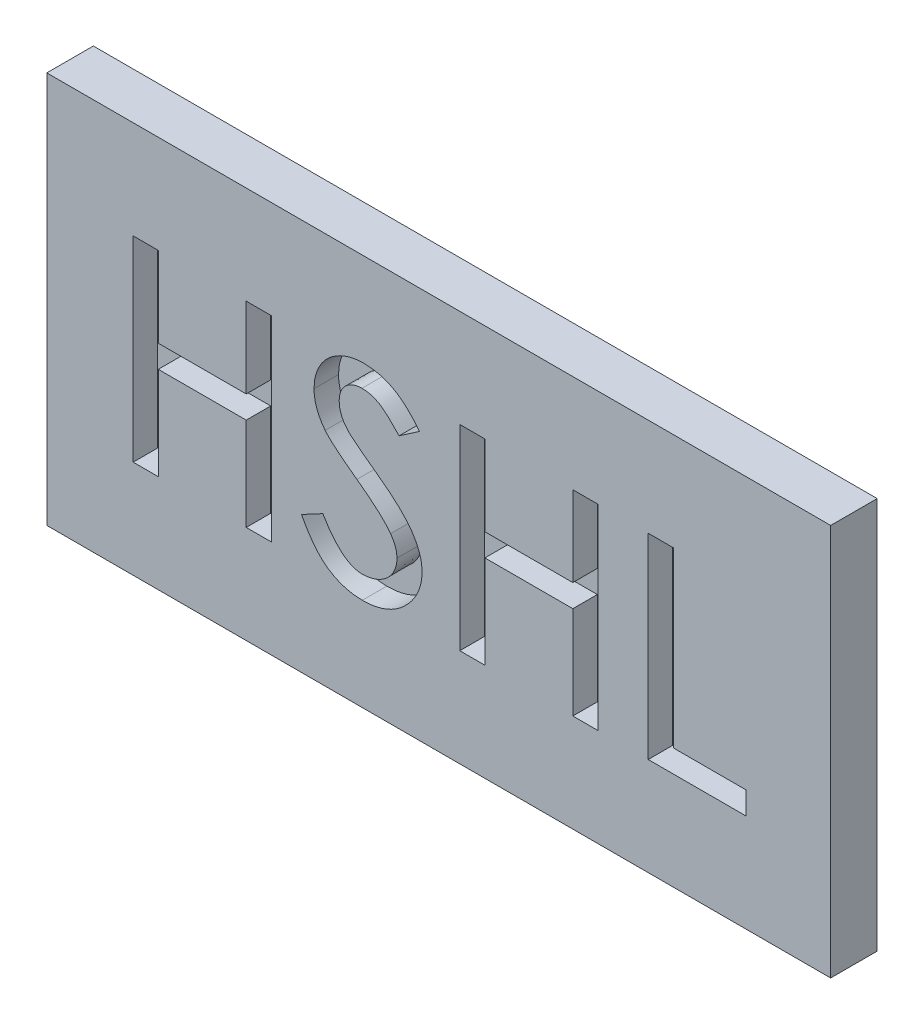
ISO-10303-21;
HEADER;
FILE_DESCRIPTION(('STEP AP214'),'2;1');
FILE_NAME('part.step','',(''),(''),'','','');
FILE_SCHEMA(('AUTOMOTIVE_DESIGN { 1 0 10303 214 1 1 1 1 }'));
ENDSEC;
DATA;
#1=APPLICATION_CONTEXT('core data for automotive mechanical design processes');
#2=APPLICATION_PROTOCOL_DEFINITION('international standard','automotive_design',2000,#1);
#3=PRODUCT_CONTEXT('',#1,'mechanical');
#4=PRODUCT('Part','Part','',(#3));
#5=PRODUCT_RELATED_PRODUCT_CATEGORY('part','',(#4));
#6=PRODUCT_DEFINITION_FORMATION('','',#4);
#7=PRODUCT_DEFINITION_CONTEXT('part definition',#1,'design');
#8=PRODUCT_DEFINITION('design','',#6,#7);
#9=PRODUCT_DEFINITION_SHAPE('','',#8);
#10=(LENGTH_UNIT() NAMED_UNIT(*) SI_UNIT(.MILLI.,.METRE.));
#11=(NAMED_UNIT(*) PLANE_ANGLE_UNIT() SI_UNIT($,.RADIAN.));
#12=(NAMED_UNIT(*) SI_UNIT($,.STERADIAN.) SOLID_ANGLE_UNIT());
#13=UNCERTAINTY_MEASURE_WITH_UNIT(LENGTH_MEASURE(1.E-05),#10,'distance_accuracy_value','');
#14=(GEOMETRIC_REPRESENTATION_CONTEXT(3) GLOBAL_UNCERTAINTY_ASSIGNED_CONTEXT((#13)) GLOBAL_UNIT_ASSIGNED_CONTEXT((#10,
#11,#12)) REPRESENTATION_CONTEXT('',''));
#15=CARTESIAN_POINT('',(0.,0.,0.));
#16=DIRECTION('',(0.,0.,1.));
#17=DIRECTION('',(1.,0.,0.));
#18=AXIS2_PLACEMENT_3D('',#15,#16,#17);
#19=CARTESIAN_POINT('',(32.,-16.,4.));
#20=DIRECTION('',(-1.,0.,0.));
#21=DIRECTION('',(0.,0.,1.));
#22=AXIS2_PLACEMENT_3D('',#19,#20,#21);
#23=PLANE('',#22);
#24=DIRECTION('',(0.,0.,-1.));
#25=VECTOR('',#24,1.);
#26=CARTESIAN_POINT('',(32.,-16.,4.));
#27=LINE('',#26,#25);
#28=CARTESIAN_POINT('',(32.,-16.,4.));
#29=VERTEX_POINT('',#28);
#30=CARTESIAN_POINT('',(32.,-16.,0.199999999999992));
#31=VERTEX_POINT('',#30);
#32=EDGE_CURVE('E636',#29,#31,#27,.T.);
#33=ORIENTED_EDGE('',*,*,#32,.T.);
#34=DIRECTION('',(0.,1.,0.));
#35=VECTOR('',#34,1.);
#36=CARTESIAN_POINT('',(32.,16.,0.199999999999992));
#37=LINE('',#36,#35);
#38=CARTESIAN_POINT('',(32.,16.,0.199999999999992));
#39=VERTEX_POINT('',#38);
#40=EDGE_CURVE('E11',#31,#39,#37,.T.);
#41=ORIENTED_EDGE('',*,*,#40,.T.);
#42=DIRECTION('',(0.,0.,-1.));
#43=VECTOR('',#42,1.);
#44=CARTESIAN_POINT('',(32.,16.,4.));
#45=LINE('',#44,#43);
#46=CARTESIAN_POINT('',(32.,16.,4.));
#47=VERTEX_POINT('',#46);
#48=EDGE_CURVE('E389',#47,#39,#45,.T.);
#49=ORIENTED_EDGE('',*,*,#48,.F.);
#50=DIRECTION('',(0.,1.,0.));
#51=VECTOR('',#50,1.);
#52=CARTESIAN_POINT('',(32.,-16.,4.));
#53=LINE('',#52,#51);
#54=EDGE_CURVE('E644',#29,#47,#53,.T.);
#55=ORIENTED_EDGE('',*,*,#54,.F.);
#56=EDGE_LOOP('',(#33,#41,#49,#55));
#57=FACE_BOUND('',#56,.T.);
#58=ADVANCED_FACE('F39',(#57),#23,.F.);
#59=CARTESIAN_POINT('',(-32.,16.,4.));
#60=DIRECTION('',(0.,-1.,0.));
#61=DIRECTION('',(0.,0.,-1.));
#62=AXIS2_PLACEMENT_3D('',#59,#60,#61);
#63=PLANE('',#62);
#64=ORIENTED_EDGE('',*,*,#48,.T.);
#65=DIRECTION('',(-1.,0.,0.));
#66=VECTOR('',#65,1.);
#67=CARTESIAN_POINT('',(-32.,16.,0.199999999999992));
#68=LINE('',#67,#66);
#69=CARTESIAN_POINT('',(-32.,16.,0.199999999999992));
#70=VERTEX_POINT('',#69);
#71=EDGE_CURVE('E388',#39,#70,#68,.T.);
#72=ORIENTED_EDGE('',*,*,#71,.T.);
#73=DIRECTION('',(0.,0.,-1.));
#74=VECTOR('',#73,1.);
#75=CARTESIAN_POINT('',(-32.,16.,4.));
#76=LINE('',#75,#74);
#77=CARTESIAN_POINT('',(-32.,16.,4.));
#78=VERTEX_POINT('',#77);
#79=EDGE_CURVE('E632',#78,#70,#76,.T.);
#80=ORIENTED_EDGE('',*,*,#79,.F.);
#81=DIRECTION('',(-1.,0.,0.));
#82=VECTOR('',#81,1.);
#83=CARTESIAN_POINT('',(-32.,16.,4.));
#84=LINE('',#83,#82);
#85=EDGE_CURVE('E642',#47,#78,#84,.T.);
#86=ORIENTED_EDGE('',*,*,#85,.F.);
#87=EDGE_LOOP('',(#64,#72,#80,#86));
#88=FACE_BOUND('',#87,.T.);
#89=ADVANCED_FACE('F569',(#88),#63,.F.);
#90=CARTESIAN_POINT('',(-32.,-16.,4.));
#91=DIRECTION('',(1.,0.,0.));
#92=DIRECTION('',(0.,0.,-1.));
#93=AXIS2_PLACEMENT_3D('',#90,#91,#92);
#94=PLANE('',#93);
#95=ORIENTED_EDGE('',*,*,#79,.T.);
#96=DIRECTION('',(0.,-1.,0.));
#97=VECTOR('',#96,1.);
#98=CARTESIAN_POINT('',(-32.,-16.,0.199999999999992));
#99=LINE('',#98,#97);
#100=CARTESIAN_POINT('',(-32.,-16.,0.199999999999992));
#101=VERTEX_POINT('',#100);
#102=EDGE_CURVE('E64',#70,#101,#99,.T.);
#103=ORIENTED_EDGE('',*,*,#102,.T.);
#104=DIRECTION('',(0.,0.,-1.));
#105=VECTOR('',#104,1.);
#106=CARTESIAN_POINT('',(-32.,-16.,4.));
#107=LINE('',#106,#105);
#108=CARTESIAN_POINT('',(-32.,-16.,4.));
#109=VERTEX_POINT('',#108);
#110=EDGE_CURVE('E634',#109,#101,#107,.T.);
#111=ORIENTED_EDGE('',*,*,#110,.F.);
#112=DIRECTION('',(0.,-1.,0.));
#113=VECTOR('',#112,1.);
#114=CARTESIAN_POINT('',(-32.,-16.,4.));
#115=LINE('',#114,#113);
#116=EDGE_CURVE('E640',#78,#109,#115,.T.);
#117=ORIENTED_EDGE('',*,*,#116,.F.);
#118=EDGE_LOOP('',(#95,#103,#111,#117));
#119=FACE_BOUND('',#118,.T.);
#120=ADVANCED_FACE('F566',(#119),#94,.F.);
#121=CARTESIAN_POINT('',(-32.,-16.,4.));
#122=DIRECTION('',(0.,1.,0.));
#123=DIRECTION('',(0.,0.,1.));
#124=AXIS2_PLACEMENT_3D('',#121,#122,#123);
#125=PLANE('',#124);
#126=ORIENTED_EDGE('',*,*,#110,.T.);
#127=DIRECTION('',(1.,0.,0.));
#128=VECTOR('',#127,1.);
#129=CARTESIAN_POINT('',(32.,-16.,0.199999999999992));
#130=LINE('',#129,#128);
#131=EDGE_CURVE('E49',#101,#31,#130,.T.);
#132=ORIENTED_EDGE('',*,*,#131,.T.);
#133=ORIENTED_EDGE('',*,*,#32,.F.);
#134=DIRECTION('',(1.,0.,0.));
#135=VECTOR('',#134,1.);
#136=CARTESIAN_POINT('',(-32.,-16.,4.));
#137=LINE('',#136,#135);
#138=EDGE_CURVE('E638',#109,#29,#137,.T.);
#139=ORIENTED_EDGE('',*,*,#138,.F.);
#140=EDGE_LOOP('',(#126,#132,#133,#139));
#141=FACE_BOUND('',#140,.T.);
#142=ADVANCED_FACE('F559',(#141),#125,.F.);
#143=CARTESIAN_POINT('',(0.,0.,4.));
#144=DIRECTION('',(0.,0.,-1.));
#145=DIRECTION('',(-1.,0.,0.));
#146=AXIS2_PLACEMENT_3D('',#143,#144,#145);
#147=PLANE('',#146);
#148=DIRECTION('',(-1.,0.,0.));
#149=VECTOR('',#148,1.);
#150=CARTESIAN_POINT('',(25.1025641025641,-8.,4.));
#151=LINE('',#150,#149);
#152=CARTESIAN_POINT('',(25.1025641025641,-8.,4.));
#153=VERTEX_POINT('',#152);
#154=CARTESIAN_POINT('',(17.1025641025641,-8.,4.));
#155=VERTEX_POINT('',#154);
#156=EDGE_CURVE('E406',#153,#155,#151,.T.);
#157=ORIENTED_EDGE('',*,*,#156,.T.);
#158=DIRECTION('',(0.,1.,0.));
#159=VECTOR('',#158,1.);
#160=CARTESIAN_POINT('',(17.1025641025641,-8.,4.));
#161=LINE('',#160,#159);
#162=CARTESIAN_POINT('',(17.1025641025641,8.,4.));
#163=VERTEX_POINT('',#162);
#164=EDGE_CURVE('E1094',#155,#163,#161,.T.);
#165=ORIENTED_EDGE('',*,*,#164,.T.);
#166=DIRECTION('',(1.,0.,0.));
#167=VECTOR('',#166,1.);
#168=CARTESIAN_POINT('',(17.1025641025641,8.,4.));
#169=LINE('',#168,#167);
#170=CARTESIAN_POINT('',(19.1538461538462,8.,4.));
#171=VERTEX_POINT('',#170);
#172=EDGE_CURVE('E403',#163,#171,#169,.T.);
#173=ORIENTED_EDGE('',*,*,#172,.T.);
#174=DIRECTION('',(0.,-1.,0.));
#175=VECTOR('',#174,1.);
#176=CARTESIAN_POINT('',(19.1538461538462,8.,4.));
#177=LINE('',#176,#175);
#178=CARTESIAN_POINT('',(19.1538461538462,-6.15384615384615,4.));
#179=VERTEX_POINT('',#178);
#180=EDGE_CURVE('E1097',#171,#179,#177,.T.);
#181=ORIENTED_EDGE('',*,*,#180,.T.);
#182=DIRECTION('',(1.,0.,0.));
#183=VECTOR('',#182,1.);
#184=CARTESIAN_POINT('',(19.1538461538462,-6.15384615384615,4.));
#185=LINE('',#184,#183);
#186=CARTESIAN_POINT('',(25.1025641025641,-6.15384615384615,4.));
#187=VERTEX_POINT('',#186);
#188=EDGE_CURVE('E1100',#179,#187,#185,.T.);
#189=ORIENTED_EDGE('',*,*,#188,.T.);
#190=DIRECTION('',(0.,-1.,0.));
#191=VECTOR('',#190,1.);
#192=CARTESIAN_POINT('',(25.1025641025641,-6.15384615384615,4.));
#193=LINE('',#192,#191);
#194=EDGE_CURVE('E411',#187,#153,#193,.T.);
#195=ORIENTED_EDGE('',*,*,#194,.T.);
#196=EDGE_LOOP('',(#157,#165,#173,#181,#189,#195));
#197=FACE_BOUND('',#196,.T.);
#198=DIRECTION('',(-1.,0.,0.));
#199=VECTOR('',#198,1.);
#200=CARTESIAN_POINT('',(3.76923076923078,-8.,4.));
#201=LINE('',#200,#199);
#202=CARTESIAN_POINT('',(3.76923076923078,-8.,4.));
#203=VERTEX_POINT('',#202);
#204=CARTESIAN_POINT('',(1.71794871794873,-8.,4.));
#205=VERTEX_POINT('',#204);
#206=EDGE_CURVE('E448',#203,#205,#201,.T.);
#207=ORIENTED_EDGE('',*,*,#206,.T.);
#208=DIRECTION('',(0.,1.,0.));
#209=VECTOR('',#208,1.);
#210=CARTESIAN_POINT('',(1.71794871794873,-8.,4.));
#211=LINE('',#210,#209);
#212=CARTESIAN_POINT('',(1.71794871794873,8.,4.));
#213=VERTEX_POINT('',#212);
#214=EDGE_CURVE('E415',#205,#213,#211,.T.);
#215=ORIENTED_EDGE('',*,*,#214,.T.);
#216=DIRECTION('',(1.,0.,0.));
#217=VECTOR('',#216,1.);
#218=CARTESIAN_POINT('',(1.71794871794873,8.,4.));
#219=LINE('',#218,#217);
#220=CARTESIAN_POINT('',(3.76923076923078,8.,4.));
#221=VERTEX_POINT('',#220);
#222=EDGE_CURVE('E418',#213,#221,#219,.T.);
#223=ORIENTED_EDGE('',*,*,#222,.T.);
#224=DIRECTION('',(0.,-1.,0.));
#225=VECTOR('',#224,1.);
#226=CARTESIAN_POINT('',(3.76923076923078,8.,4.));
#227=LINE('',#226,#225);
#228=CARTESIAN_POINT('',(3.76923076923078,1.43589743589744,4.));
#229=VERTEX_POINT('',#228);
#230=EDGE_CURVE('E421',#221,#229,#227,.T.);
#231=ORIENTED_EDGE('',*,*,#230,.T.);
#232=DIRECTION('',(1.,0.,0.));
#233=VECTOR('',#232,1.);
#234=CARTESIAN_POINT('',(3.76923076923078,1.43589743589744,4.));
#235=LINE('',#234,#233);
#236=CARTESIAN_POINT('',(10.948717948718,1.43589743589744,4.));
#237=VERTEX_POINT('',#236);
#238=EDGE_CURVE('E424',#229,#237,#235,.T.);
#239=ORIENTED_EDGE('',*,*,#238,.T.);
#240=DIRECTION('',(0.,1.,0.));
#241=VECTOR('',#240,1.);
#242=CARTESIAN_POINT('',(10.948717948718,1.43589743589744,4.));
#243=LINE('',#242,#241);
#244=CARTESIAN_POINT('',(10.948717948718,8.,4.));
#245=VERTEX_POINT('',#244);
#246=EDGE_CURVE('E427',#237,#245,#243,.T.);
#247=ORIENTED_EDGE('',*,*,#246,.T.);
#248=DIRECTION('',(1.,0.,0.));
#249=VECTOR('',#248,1.);
#250=CARTESIAN_POINT('',(10.948717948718,8.,4.));
#251=LINE('',#250,#249);
#252=CARTESIAN_POINT('',(13.,8.,4.));
#253=VERTEX_POINT('',#252);
#254=EDGE_CURVE('E430',#245,#253,#251,.T.);
#255=ORIENTED_EDGE('',*,*,#254,.T.);
#256=DIRECTION('',(0.,-1.,0.));
#257=VECTOR('',#256,1.);
#258=CARTESIAN_POINT('',(13.,8.,4.));
#259=LINE('',#258,#257);
#260=CARTESIAN_POINT('',(13.,-8.,4.));
#261=VERTEX_POINT('',#260);
#262=EDGE_CURVE('E433',#253,#261,#259,.T.);
#263=ORIENTED_EDGE('',*,*,#262,.T.);
#264=DIRECTION('',(-1.,0.,0.));
#265=VECTOR('',#264,1.);
#266=CARTESIAN_POINT('',(13.,-8.,4.));
#267=LINE('',#266,#265);
#268=CARTESIAN_POINT('',(10.948717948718,-8.,4.));
#269=VERTEX_POINT('',#268);
#270=EDGE_CURVE('E436',#261,#269,#267,.T.);
#271=ORIENTED_EDGE('',*,*,#270,.T.);
#272=DIRECTION('',(0.,1.,0.));
#273=VECTOR('',#272,1.);
#274=CARTESIAN_POINT('',(10.948717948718,-8.,4.));
#275=LINE('',#274,#273);
#276=CARTESIAN_POINT('',(10.948717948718,-0.41025641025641,4.));
#277=VERTEX_POINT('',#276);
#278=EDGE_CURVE('E439',#269,#277,#275,.T.);
#279=ORIENTED_EDGE('',*,*,#278,.T.);
#280=DIRECTION('',(-1.,0.,0.));
#281=VECTOR('',#280,1.);
#282=CARTESIAN_POINT('',(10.948717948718,-0.41025641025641,4.));
#283=LINE('',#282,#281);
#284=CARTESIAN_POINT('',(3.76923076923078,-0.41025641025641,4.));
#285=VERTEX_POINT('',#284);
#286=EDGE_CURVE('E442',#277,#285,#283,.T.);
#287=ORIENTED_EDGE('',*,*,#286,.T.);
#288=DIRECTION('',(0.,-1.,0.));
#289=VECTOR('',#288,1.);
#290=CARTESIAN_POINT('',(3.76923076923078,-0.41025641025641,4.));
#291=LINE('',#290,#289);
#292=EDGE_CURVE('E445',#285,#203,#291,.T.);
#293=ORIENTED_EDGE('',*,*,#292,.T.);
#294=EDGE_LOOP('',(#207,#215,#223,#231,#239,#247,#255,#263,#271,#279,#287,#293));
#295=FACE_BOUND('',#294,.T.);
#296=CARTESIAN_POINT('',(-1.35897435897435,-3.96794871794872,4.));
#297=CARTESIAN_POINT('',(-1.36351592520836,-4.11027370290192,4.));
#298=CARTESIAN_POINT('',(-1.37254263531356,-4.39315549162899,4.));
#299=CARTESIAN_POINT('',(-1.43798877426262,-4.81141432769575,4.));
#300=CARTESIAN_POINT('',(-1.54688539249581,-5.21794756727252,4.));
#301=CARTESIAN_POINT('',(-1.70355290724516,-5.61103856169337,4.));
#302=CARTESIAN_POINT('',(-1.89896341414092,-5.99437656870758,4.));
#303=CARTESIAN_POINT('',(-2.14125937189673,-6.36461020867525,4.));
#304=CARTESIAN_POINT('',(-2.42965102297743,-6.72031282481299,4.));
#305=CARTESIAN_POINT('',(-2.75197160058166,-7.06363379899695,4.));
#306=CARTESIAN_POINT('',(-3.10837677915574,-7.37915916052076,4.));
#307=CARTESIAN_POINT('',(-3.4905808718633,-7.65686309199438,4.));
#308=CARTESIAN_POINT('',(-3.89741697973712,-7.8888554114,4.));
#309=CARTESIAN_POINT('',(-4.32575006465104,-8.07707690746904,4.));
#310=CARTESIAN_POINT('',(-4.77306687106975,-8.23045405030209,4.));
#311=CARTESIAN_POINT('',(-5.24378791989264,-8.33550456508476,4.));
#312=CARTESIAN_POINT('',(-5.73558508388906,-8.39614127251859,4.));
#313=CARTESIAN_POINT('',(-6.07034499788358,-8.4055017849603,4.));
#314=CARTESIAN_POINT('',(-6.24038461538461,-8.41025641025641,4.));
#315=B_SPLINE_CURVE_WITH_KNOTS('',3,(#296,#297,#298,#299,#300,#301,#302,#303,#304,#305,#306,
#307,#308,#309,#310,#311,#312,#313,#314),.UNSPECIFIED.,.F.,.F.,(4,1,1,1,1,1,1,1,1,1,1,1,1,1,1,1,
4),(0.,0.0582903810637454,0.115856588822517,0.172975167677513,0.230354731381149,
0.288881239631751,0.348970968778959,0.411239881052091,0.476256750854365,0.541680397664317,
0.605940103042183,0.669454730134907,0.733135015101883,0.797354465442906,0.862865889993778,
0.930343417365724,1.),.UNSPECIFIED.);
#316=CARTESIAN_POINT('',(-1.35897435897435,-3.96794871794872,4.));
#317=VERTEX_POINT('',#316);
#318=CARTESIAN_POINT('',(-6.24038461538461,-8.41025641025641,4.));
#319=VERTEX_POINT('',#318);
#320=EDGE_CURVE('E724',#317,#319,#315,.T.);
#321=ORIENTED_EDGE('',*,*,#320,.T.);
#322=CARTESIAN_POINT('',(-6.24038461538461,-8.41025641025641,4.));
#323=CARTESIAN_POINT('',(-6.36437943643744,-8.40750232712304,4.));
#324=CARTESIAN_POINT('',(-6.60859796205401,-8.40207792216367,4.));
#325=CARTESIAN_POINT('',(-6.97115931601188,-8.36766995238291,4.));
#326=CARTESIAN_POINT('',(-7.32397667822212,-8.30153817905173,4.));
#327=CARTESIAN_POINT('',(-7.66898442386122,-8.21603645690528,4.));
#328=CARTESIAN_POINT('',(-8.00639787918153,-8.1071615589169,4.));
#329=CARTESIAN_POINT('',(-8.33186871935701,-7.9678906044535,4.));
#330=CARTESIAN_POINT('',(-8.65081678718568,-7.80791866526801,4.));
#331=CARTESIAN_POINT('',(-8.96141244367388,-7.6206080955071,4.));
#332=CARTESIAN_POINT('',(-9.26405175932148,-7.40128216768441,4.));
#333=CARTESIAN_POINT('',(-9.56045459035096,-7.14668790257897,4.));
#334=CARTESIAN_POINT('',(-9.84889920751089,-6.85234984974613,4.));
#335=CARTESIAN_POINT('',(-10.1343301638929,-6.52209207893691,4.));
#336=CARTESIAN_POINT('',(-10.4129765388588,-6.15219987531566,4.));
#337=CARTESIAN_POINT('',(-10.684187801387,-5.74461825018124,4.));
#338=CARTESIAN_POINT('',(-10.9514268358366,-5.30066153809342,4.));
#339=CARTESIAN_POINT('',(-11.118894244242,-4.98794839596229,4.));
#340=CARTESIAN_POINT('',(-11.2051282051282,-4.82692307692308,4.));
#341=B_SPLINE_CURVE_WITH_KNOTS('',3,(#322,#323,#324,#325,#326,#327,#328,#329,#330,#331,#332,
#333,#334,#335,#336,#337,#338,#339,#340),.UNSPECIFIED.,.F.,.F.,(4,1,1,1,1,1,1,1,1,1,1,1,1,1,1,1,
4),(0.,0.0573089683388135,0.112874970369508,0.168077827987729,0.223043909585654,
0.277068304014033,0.331723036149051,0.386484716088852,0.441863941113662,0.499147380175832,
0.559021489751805,0.622215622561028,0.689427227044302,0.760626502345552,0.836081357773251,
0.91559340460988,1.),.UNSPECIFIED.);
#342=CARTESIAN_POINT('',(-11.2051282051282,-4.82692307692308,4.));
#343=VERTEX_POINT('',#342);
#344=EDGE_CURVE('E455',#319,#343,#341,.T.);
#345=ORIENTED_EDGE('',*,*,#344,.T.);
#346=DIRECTION('',(0.882442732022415,0.470419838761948,0.));
#347=VECTOR('',#346,1.);
#348=CARTESIAN_POINT('',(-11.2051282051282,-4.82692307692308,4.));
#349=LINE('',#348,#347);
#350=CARTESIAN_POINT('',(-9.46153846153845,-3.8974358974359,4.));
#351=VERTEX_POINT('',#350);
#352=EDGE_CURVE('E493',#343,#351,#349,.T.);
#353=ORIENTED_EDGE('',*,*,#352,.T.);
#354=CARTESIAN_POINT('',(-9.46153846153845,-3.8974358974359,4.));
#355=CARTESIAN_POINT('',(-9.33447326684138,-4.10790959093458,4.));
#356=CARTESIAN_POINT('',(-9.09161647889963,-4.51018312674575,4.));
#357=CARTESIAN_POINT('',(-8.69283330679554,-5.05209333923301,4.));
#358=CARTESIAN_POINT('',(-8.29633482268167,-5.51420032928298,4.));
#359=CARTESIAN_POINT('',(-7.89820711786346,-5.89603751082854,4.));
#360=CARTESIAN_POINT('',(-7.49291989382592,-6.19147145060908,4.));
#361=CARTESIAN_POINT('',(-7.08461068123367,-6.40498772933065,4.));
#362=CARTESIAN_POINT('',(-6.67072395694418,-6.53918980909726,4.));
#363=CARTESIAN_POINT('',(-6.39088178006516,-6.55588759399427,4.));
#364=CARTESIAN_POINT('',(-6.25320512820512,-6.56410256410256,4.));
#365=B_SPLINE_CURVE_WITH_KNOTS('',3,(#354,#355,#356,#357,#358,#359,#360,#361,#362,#363,#364),
.UNSPECIFIED.,.F.,.F.,(4,1,1,1,1,1,1,1,4),(0.,0.169367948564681,0.323709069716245,
0.463075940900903,0.588607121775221,0.703049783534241,0.807443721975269,0.905266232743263,1.),.UNSPECIFIED.);
#366=CARTESIAN_POINT('',(-6.25320512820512,-6.56410256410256,4.));
#367=VERTEX_POINT('',#366);
#368=EDGE_CURVE('E899',#351,#367,#365,.T.);
#369=ORIENTED_EDGE('',*,*,#368,.T.);
#370=CARTESIAN_POINT('',(-6.25320512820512,-6.56410256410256,4.));
#371=CARTESIAN_POINT('',(-6.12467656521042,-6.55997112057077,4.));
#372=CARTESIAN_POINT('',(-5.87009845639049,-6.5517879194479,4.));
#373=CARTESIAN_POINT('',(-5.4960455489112,-6.48081940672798,4.));
#374=CARTESIAN_POINT('',(-5.13386329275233,-6.37268841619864,4.));
#375=CARTESIAN_POINT('',(-4.78982763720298,-6.21871228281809,4.));
#376=CARTESIAN_POINT('',(-4.47198594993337,-6.03007263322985,4.));
#377=CARTESIAN_POINT('',(-4.19140160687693,-5.80569386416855,4.));
#378=CARTESIAN_POINT('',(-3.95333361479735,-5.55166403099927,4.));
#379=CARTESIAN_POINT('',(-3.75711039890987,-5.27142922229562,4.));
#380=CARTESIAN_POINT('',(-3.60329893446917,-4.97222377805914,4.));
#381=CARTESIAN_POINT('',(-3.49007008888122,-4.66253789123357,4.));
#382=CARTESIAN_POINT('',(-3.42361605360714,-4.34147924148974,4.));
#383=CARTESIAN_POINT('',(-3.41474209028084,-4.1253010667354,4.));
#384=CARTESIAN_POINT('',(-3.4102564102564,-4.01602564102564,4.));
#385=B_SPLINE_CURVE_WITH_KNOTS('',3,(#370,#371,#372,#373,#374,#375,#376,#377,#378,#379,#380,
#381,#382,#383,#384),.UNSPECIFIED.,.F.,.F.,(4,1,1,1,1,1,1,1,1,1,1,1,4),(0.,0.0907379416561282,
0.179725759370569,0.268080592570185,0.357295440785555,0.445327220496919,0.528557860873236,
0.610268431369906,0.690476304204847,0.769478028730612,0.847320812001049,0.922822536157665,1.),.UNSPECIFIED.);
#386=CARTESIAN_POINT('',(-3.4102564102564,-4.01602564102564,4.));
#387=VERTEX_POINT('',#386);
#388=EDGE_CURVE('E900',#367,#387,#385,.T.);
#389=ORIENTED_EDGE('',*,*,#388,.T.);
#390=CARTESIAN_POINT('',(-3.4102564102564,-4.01602564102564,4.));
#391=CARTESIAN_POINT('',(-3.41654126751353,-3.89148614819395,4.));
#392=CARTESIAN_POINT('',(-3.4292415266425,-3.63982031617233,4.));
#393=CARTESIAN_POINT('',(-3.53117688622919,-3.26596771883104,4.));
#394=CARTESIAN_POINT('',(-3.69684044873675,-2.89577309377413,4.));
#395=CARTESIAN_POINT('',(-3.85008297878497,-2.66463723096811,4.));
#396=CARTESIAN_POINT('',(-3.92948717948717,-2.54487179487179,4.));
#397=B_SPLINE_CURVE_WITH_KNOTS('',3,(#390,#391,#392,#393,#394,#395,#396),.UNSPECIFIED.,.F.,.F.,
(4,1,1,1,4),(0.,0.235465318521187,0.475821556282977,0.7283915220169,1.),.UNSPECIFIED.);
#398=CARTESIAN_POINT('',(-3.92948717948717,-2.54487179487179,4.));
#399=VERTEX_POINT('',#398);
#400=EDGE_CURVE('E902',#387,#399,#397,.T.);
#401=ORIENTED_EDGE('',*,*,#400,.T.);
#402=CARTESIAN_POINT('',(-3.92948717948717,-2.54487179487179,4.));
#403=CARTESIAN_POINT('',(-3.99814829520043,-2.45769125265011,4.));
#404=CARTESIAN_POINT('',(-4.14268577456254,-2.27416880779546,4.));
#405=CARTESIAN_POINT('',(-4.38734673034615,-1.9978729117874,4.));
#406=CARTESIAN_POINT('',(-4.67363216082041,-1.70965530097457,4.));
#407=CARTESIAN_POINT('',(-5.00107766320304,-1.41081622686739,4.));
#408=CARTESIAN_POINT('',(-5.36392773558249,-1.09465960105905,4.));
#409=CARTESIAN_POINT('',(-5.76834597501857,-0.76935665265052,4.));
#410=CARTESIAN_POINT('',(-6.21147343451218,-0.42940970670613,4.));
#411=CARTESIAN_POINT('',(-6.52200485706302,-0.201346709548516,4.));
#412=CARTESIAN_POINT('',(-6.6826923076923,-0.0833333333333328,4.));
#413=B_SPLINE_CURVE_WITH_KNOTS('',3,(#402,#403,#404,#405,#406,#407,#408,#409,#410,#411,#412),
.UNSPECIFIED.,.F.,.F.,(4,1,1,1,1,1,1,1,4),(0.,0.0898242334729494,0.189087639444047,
0.298560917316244,0.418529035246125,0.547896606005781,0.688105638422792,0.838607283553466,1.),.UNSPECIFIED.);
#414=CARTESIAN_POINT('',(-6.6826923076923,-0.0833333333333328,4.));
#415=VERTEX_POINT('',#414);
#416=EDGE_CURVE('E933',#399,#415,#413,.T.);
#417=ORIENTED_EDGE('',*,*,#416,.T.);
#418=CARTESIAN_POINT('',(-6.6826923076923,-0.0833333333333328,4.));
#419=CARTESIAN_POINT('',(-6.84655144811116,0.0357869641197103,4.));
#420=CARTESIAN_POINT('',(-7.16095125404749,0.264345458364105,4.));
#421=CARTESIAN_POINT('',(-7.60391312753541,0.599413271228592,4.));
#422=CARTESIAN_POINT('',(-8.00107155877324,0.908364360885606,4.));
#423=CARTESIAN_POINT('',(-8.34938098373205,1.1914402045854,4.));
#424=CARTESIAN_POINT('',(-8.6488809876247,1.45110117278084,4.));
#425=CARTESIAN_POINT('',(-8.89894065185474,1.68628176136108,4.));
#426=CARTESIAN_POINT('',(-9.10708780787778,1.89052799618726,4.));
#427=CARTESIAN_POINT('',(-9.21894015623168,2.02795444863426,4.));
#428=CARTESIAN_POINT('',(-9.26923076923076,2.08974358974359,4.));
#429=B_SPLINE_CURVE_WITH_KNOTS('',3,(#418,#419,#420,#421,#422,#423,#424,#425,#426,#427,#428),
.UNSPECIFIED.,.F.,.F.,(4,1,1,1,1,1,1,1,4),(0.,0.179479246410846,0.344370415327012,
0.492060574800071,0.625259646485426,0.741997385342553,0.843119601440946,0.929464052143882,1.),.UNSPECIFIED.);
#430=CARTESIAN_POINT('',(-9.26923076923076,2.08974358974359,4.));
#431=VERTEX_POINT('',#430);
#432=EDGE_CURVE('E942',#415,#431,#429,.T.);
#433=ORIENTED_EDGE('',*,*,#432,.T.);
#434=CARTESIAN_POINT('',(-9.26923076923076,2.08974358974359,4.));
#435=CARTESIAN_POINT('',(-9.34264826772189,2.18460614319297,4.));
#436=CARTESIAN_POINT('',(-9.48688284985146,2.37097126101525,4.));
#437=CARTESIAN_POINT('',(-9.66948882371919,2.66991297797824,4.));
#438=CARTESIAN_POINT('',(-9.82661717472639,2.9727671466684,4.));
#439=CARTESIAN_POINT('',(-9.95603567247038,3.28233800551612,4.));
#440=CARTESIAN_POINT('',(-10.0563272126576,3.59763658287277,4.));
#441=CARTESIAN_POINT('',(-10.1253230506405,3.91976860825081,4.));
#442=CARTESIAN_POINT('',(-10.1739915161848,4.24745450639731,4.));
#443=CARTESIAN_POINT('',(-10.177648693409,4.46883755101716,4.));
#444=CARTESIAN_POINT('',(-10.1794871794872,4.58012820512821,4.));
#445=B_SPLINE_CURVE_WITH_KNOTS('',3,(#434,#435,#436,#437,#438,#439,#440,#441,#442,#443,#444),
.UNSPECIFIED.,.F.,.F.,(4,1,1,1,1,1,1,1,4),(0.,0.133013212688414,0.261315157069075,
0.388035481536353,0.511326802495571,0.633179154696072,0.754563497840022,0.876617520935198,1.),.UNSPECIFIED.);
#446=CARTESIAN_POINT('',(-10.1794871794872,4.58012820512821,4.));
#447=VERTEX_POINT('',#446);
#448=EDGE_CURVE('E950',#431,#447,#445,.T.);
#449=ORIENTED_EDGE('',*,*,#448,.T.);
#450=CARTESIAN_POINT('',(-10.1794871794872,4.58012820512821,4.));
#451=CARTESIAN_POINT('',(-10.1736975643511,4.75368412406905,4.));
#452=CARTESIAN_POINT('',(-10.16223454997,5.09731214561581,4.));
#453=CARTESIAN_POINT('',(-10.0597967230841,5.59895758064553,4.));
#454=CARTESIAN_POINT('',(-9.89379446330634,6.07693608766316,4.));
#455=CARTESIAN_POINT('',(-9.66720314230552,6.52877726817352,4.));
#456=CARTESIAN_POINT('',(-9.37785015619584,6.94607051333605,4.));
#457=CARTESIAN_POINT('',(-9.0336765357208,7.32057475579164,4.));
#458=CARTESIAN_POINT('',(-8.63282006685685,7.64429878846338,4.));
#459=CARTESIAN_POINT('',(-8.18597628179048,7.91707055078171,4.));
#460=CARTESIAN_POINT('',(-7.70433136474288,8.13829026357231,4.));
#461=CARTESIAN_POINT('',(-7.19704639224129,8.29596554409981,4.));
#462=CARTESIAN_POINT('',(-6.67027106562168,8.39155388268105,4.));
#463=CARTESIAN_POINT('',(-6.31236157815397,8.40397603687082,4.));
#464=CARTESIAN_POINT('',(-6.13141025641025,8.41025641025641,4.));
#465=B_SPLINE_CURVE_WITH_KNOTS('',3,(#450,#451,#452,#453,#454,#455,#456,#457,#458,#459,#460,
#461,#462,#463,#464),.UNSPECIFIED.,.F.,.F.,(4,1,1,1,1,1,1,1,1,1,1,1,4),(0.,0.0837108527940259,
0.16574136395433,0.245990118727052,0.327410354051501,0.408957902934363,0.490350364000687,
0.572108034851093,0.656848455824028,0.742472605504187,0.82729773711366,0.912685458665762,1.),.UNSPECIFIED.);
#466=CARTESIAN_POINT('',(-6.13141025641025,8.41025641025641,4.));
#467=VERTEX_POINT('',#466);
#468=EDGE_CURVE('E859',#447,#467,#465,.T.);
#469=ORIENTED_EDGE('',*,*,#468,.T.);
#470=CARTESIAN_POINT('',(-6.13141025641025,8.41025641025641,4.));
#471=CARTESIAN_POINT('',(-5.92595035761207,8.40290226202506,4.));
#472=CARTESIAN_POINT('',(-5.51903603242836,8.38833733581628,4.));
#473=CARTESIAN_POINT('',(-4.91920606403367,8.28963318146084,4.));
#474=CARTESIAN_POINT('',(-4.34562124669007,8.11192312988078,4.));
#475=CARTESIAN_POINT('',(-3.88366197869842,7.91576423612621,4.));
#476=CARTESIAN_POINT('',(-3.52480412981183,7.71520721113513,4.));
#477=CARTESIAN_POINT('',(-3.25339259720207,7.5340698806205,4.));
#478=CARTESIAN_POINT('',(-2.97520977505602,7.32907399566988,4.));
#479=CARTESIAN_POINT('',(-2.69906653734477,7.09000066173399,4.));
#480=CARTESIAN_POINT('',(-2.41420031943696,6.82841714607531,4.));
#481=CARTESIAN_POINT('',(-2.13519855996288,6.53010437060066,4.));
#482=CARTESIAN_POINT('',(-1.84440471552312,6.21215901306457,4.));
#483=CARTESIAN_POINT('',(-1.65906336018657,5.98286488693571,4.));
#484=CARTESIAN_POINT('',(-1.56410256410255,5.86538461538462,4.));
#485=B_SPLINE_CURVE_WITH_KNOTS('',3,(#470,#471,#472,#473,#474,#475,#476,#477,#478,#479,#480,
#481,#482,#483,#484),.UNSPECIFIED.,.F.,.F.,(4,1,1,1,1,1,1,1,1,1,1,1,4),(0.,0.113382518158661,
0.224554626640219,0.334220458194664,0.444071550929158,0.500820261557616,0.560831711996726,
0.624033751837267,0.691370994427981,0.762285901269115,0.83734407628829,0.916662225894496,1.),.UNSPECIFIED.);
#486=CARTESIAN_POINT('',(-1.56410256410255,5.86538461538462,4.));
#487=VERTEX_POINT('',#486);
#488=EDGE_CURVE('E853',#467,#487,#485,.T.);
#489=ORIENTED_EDGE('',*,*,#488,.T.);
#490=DIRECTION('',(-0.824686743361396,-0.565589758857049,0.));
#491=VECTOR('',#490,1.);
#492=CARTESIAN_POINT('',(-1.56410256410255,5.86538461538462,4.));
#493=LINE('',#492,#491);
#494=CARTESIAN_POINT('',(-3.23717948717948,4.71794871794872,4.));
#495=VERTEX_POINT('',#494);
#496=EDGE_CURVE('E858',#487,#495,#493,.T.);
#497=ORIENTED_EDGE('',*,*,#496,.T.);
#498=CARTESIAN_POINT('',(-3.23717948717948,4.71794871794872,4.));
#499=CARTESIAN_POINT('',(-3.32449284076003,4.81117574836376,4.));
#500=CARTESIAN_POINT('',(-3.49237450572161,4.9904279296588,4.));
#501=CARTESIAN_POINT('',(-3.73932494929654,5.24463491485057,4.));
#502=CARTESIAN_POINT('',(-3.97297374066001,5.47276751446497,4.));
#503=CARTESIAN_POINT('',(-4.19402996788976,5.67378209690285,4.));
#504=CARTESIAN_POINT('',(-4.39753897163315,5.85126350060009,4.));
#505=CARTESIAN_POINT('',(-4.58921916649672,5.99922701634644,4.));
#506=CARTESIAN_POINT('',(-4.76307647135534,6.12639493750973,4.));
#507=CARTESIAN_POINT('',(-4.98041352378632,6.25243237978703,4.));
#508=CARTESIAN_POINT('',(-5.24685235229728,6.37725798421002,4.));
#509=CARTESIAN_POINT('',(-5.57477603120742,6.4895723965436,4.));
#510=CARTESIAN_POINT('',(-5.91875384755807,6.54959754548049,4.));
#511=CARTESIAN_POINT('',(-6.1515032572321,6.55923023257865,4.));
#512=CARTESIAN_POINT('',(-6.26923076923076,6.56410256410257,4.));
#513=B_SPLINE_CURVE_WITH_KNOTS('',3,(#498,#499,#500,#501,#502,#503,#504,#505,#506,#507,#508,
#509,#510,#511,#512),.UNSPECIFIED.,.F.,.F.,(4,1,1,1,1,1,1,1,1,1,1,1,4),(0.,0.104448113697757,
0.200827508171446,0.289794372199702,0.371423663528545,0.445147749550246,0.510508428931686,
0.569413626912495,0.621107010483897,0.715687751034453,0.809620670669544,0.903703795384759,1.),.UNSPECIFIED.);
#514=CARTESIAN_POINT('',(-6.26923076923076,6.56410256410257,4.));
#515=VERTEX_POINT('',#514);
#516=EDGE_CURVE('E825',#495,#515,#513,.T.);
#517=ORIENTED_EDGE('',*,*,#516,.T.);
#518=CARTESIAN_POINT('',(-6.26923076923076,6.56410256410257,4.));
#519=CARTESIAN_POINT('',(-6.39489231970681,6.55823013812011,4.));
#520=CARTESIAN_POINT('',(-6.63918863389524,6.54681366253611,4.));
#521=CARTESIAN_POINT('',(-6.99010747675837,6.4490507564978,4.));
#522=CARTESIAN_POINT('',(-7.31268672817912,6.29478422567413,4.));
#523=CARTESIAN_POINT('',(-7.59729206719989,6.07645577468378,4.));
#524=CARTESIAN_POINT('',(-7.83384712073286,5.80622360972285,4.));
#525=CARTESIAN_POINT('',(-8.00733186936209,5.4896808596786,4.));
#526=CARTESIAN_POINT('',(-8.1088599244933,5.12893831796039,4.));
#527=CARTESIAN_POINT('',(-8.12157474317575,4.87566431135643,4.));
#528=CARTESIAN_POINT('',(-8.12820512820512,4.74358974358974,4.));
#529=B_SPLINE_CURVE_WITH_KNOTS('',3,(#518,#519,#520,#521,#522,#523,#524,#525,#526,#527,#528),
.UNSPECIFIED.,.F.,.F.,(4,1,1,1,1,1,1,1,4),(0.,0.129189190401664,0.251154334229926,
0.372198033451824,0.495421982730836,0.617857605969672,0.739464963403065,0.864139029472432,1.),.UNSPECIFIED.);
#530=CARTESIAN_POINT('',(-8.12820512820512,4.74358974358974,4.));
#531=VERTEX_POINT('',#530);
#532=EDGE_CURVE('E816',#515,#531,#529,.T.);
#533=ORIENTED_EDGE('',*,*,#532,.T.);
#534=CARTESIAN_POINT('',(-8.12820512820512,4.74358974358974,4.));
#535=CARTESIAN_POINT('',(-8.12562172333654,4.65800967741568,4.));
#536=CARTESIAN_POINT('',(-8.12046116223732,4.48705654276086,4.));
#537=CARTESIAN_POINT('',(-8.08255538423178,4.23382634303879,4.));
#538=CARTESIAN_POINT('',(-8.01248657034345,3.98914589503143,4.));
#539=CARTESIAN_POINT('',(-7.9236952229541,3.74785792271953,4.));
#540=CARTESIAN_POINT('',(-7.79941776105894,3.51131816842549,4.));
#541=CARTESIAN_POINT('',(-7.64114299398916,3.27915311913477,4.));
#542=CARTESIAN_POINT('',(-7.45325623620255,3.04467411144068,4.));
#543=CARTESIAN_POINT('',(-7.30906005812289,2.89726931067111,4.));
#544=CARTESIAN_POINT('',(-7.23397435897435,2.82051282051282,4.));
#545=B_SPLINE_CURVE_WITH_KNOTS('',3,(#534,#535,#536,#537,#538,#539,#540,#541,#542,#543,#544),
.UNSPECIFIED.,.F.,.F.,(4,1,1,1,1,1,1,1,4),(0.,0.117604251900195,0.234924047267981,
0.35069011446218,0.466855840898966,0.587687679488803,0.716774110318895,0.852518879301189,1.),.UNSPECIFIED.);
#546=CARTESIAN_POINT('',(-7.23397435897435,2.82051282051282,4.));
#547=VERTEX_POINT('',#546);
#548=EDGE_CURVE('E807',#531,#547,#545,.T.);
#549=ORIENTED_EDGE('',*,*,#548,.T.);
#550=CARTESIAN_POINT('',(-7.23397435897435,2.82051282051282,4.));
#551=CARTESIAN_POINT('',(-7.19595527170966,2.78474633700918,4.));
#552=CARTESIAN_POINT('',(-7.10869349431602,2.70265475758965,4.));
#553=CARTESIAN_POINT('',(-6.94864602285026,2.57694820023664,4.));
#554=CARTESIAN_POINT('',(-6.75365312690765,2.41934575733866,4.));
#555=CARTESIAN_POINT('',(-6.52101151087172,2.23241977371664,4.));
#556=CARTESIAN_POINT('',(-6.24307139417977,2.02631874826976,4.));
#557=CARTESIAN_POINT('',(-5.93010920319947,1.78727343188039,4.));
#558=CARTESIAN_POINT('',(-5.57420071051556,1.52604537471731,4.));
#559=CARTESIAN_POINT('',(-5.32374690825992,1.34290678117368,4.));
#560=CARTESIAN_POINT('',(-5.19230769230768,1.24679487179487,4.));
#561=B_SPLINE_CURVE_WITH_KNOTS('',3,(#550,#551,#552,#553,#554,#555,#556,#557,#558,#559,#560),
.UNSPECIFIED.,.F.,.F.,(4,1,1,1,1,1,1,1,4),(0.,0.060697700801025,0.139313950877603,
0.236560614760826,0.352441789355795,0.486424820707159,0.639050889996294,0.810572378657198,1.),.UNSPECIFIED.);
#562=CARTESIAN_POINT('',(-5.19230769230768,1.24679487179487,4.));
#563=VERTEX_POINT('',#562);
#564=EDGE_CURVE('E802',#547,#563,#561,.T.);
#565=ORIENTED_EDGE('',*,*,#564,.T.);
#566=CARTESIAN_POINT('',(-5.19230769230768,1.24679487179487,4.));
#567=CARTESIAN_POINT('',(-5.0132365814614,1.11627036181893,4.));
#568=CARTESIAN_POINT('',(-4.66681728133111,0.863766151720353,4.));
#569=CARTESIAN_POINT('',(-4.17471677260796,0.482896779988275,4.));
#570=CARTESIAN_POINT('',(-3.73091161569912,0.109551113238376,4.));
#571=CARTESIAN_POINT('',(-3.32418135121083,-0.243245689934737,4.));
#572=CARTESIAN_POINT('',(-2.96828090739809,-0.590292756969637,4.));
#573=CARTESIAN_POINT('',(-2.65654191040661,-0.924454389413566,4.));
#574=CARTESIAN_POINT('',(-2.38504950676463,-1.24246891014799,4.));
#575=CARTESIAN_POINT('',(-2.09509236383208,-1.64792852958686,4.));
#576=CARTESIAN_POINT('',(-1.80519334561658,-2.14779057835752,4.));
#577=CARTESIAN_POINT('',(-1.54596370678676,-2.75196778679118,4.));
#578=CARTESIAN_POINT('',(-1.39127325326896,-3.36091124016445,4.));
#579=CARTESIAN_POINT('',(-1.36964793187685,-3.76734560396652,4.));
#580=CARTESIAN_POINT('',(-1.35897435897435,-3.96794871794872,4.));
#581=B_SPLINE_CURVE_WITH_KNOTS('',3,(#566,#567,#568,#569,#570,#571,#572,#573,#574,#575,#576,
#577,#578,#579,#580),.UNSPECIFIED.,.F.,.F.,(4,1,1,1,1,1,1,1,1,1,1,1,4),(0.,0.0988783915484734,
0.191283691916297,0.277593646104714,0.357646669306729,0.431478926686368,0.499277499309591,
0.56153832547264,0.61789991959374,0.721500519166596,0.818718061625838,0.910524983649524,1.),.UNSPECIFIED.);
#582=EDGE_CURVE('E776',#563,#317,#581,.T.);
#583=ORIENTED_EDGE('',*,*,#582,.T.);
#584=EDGE_LOOP('',(#321,#345,#353,#369,#389,#401,#417,#433,#449,#469,#489,#497,#517,#533,#549,
#565,#583));
#585=FACE_BOUND('',#584,.T.);
#586=DIRECTION('',(-1.,0.,0.));
#587=VECTOR('',#586,1.);
#588=CARTESIAN_POINT('',(-22.8974358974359,-8.,4.));
#589=LINE('',#588,#587);
#590=CARTESIAN_POINT('',(-22.8974358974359,-8.,4.));
#591=VERTEX_POINT('',#590);
#592=CARTESIAN_POINT('',(-24.9487179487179,-8.,4.));
#593=VERTEX_POINT('',#592);
#594=EDGE_CURVE('E652',#591,#593,#589,.T.);
#595=ORIENTED_EDGE('',*,*,#594,.T.);
#596=DIRECTION('',(0.,1.,0.));
#597=VECTOR('',#596,1.);
#598=CARTESIAN_POINT('',(-24.9487179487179,-8.,4.));
#599=LINE('',#598,#597);
#600=CARTESIAN_POINT('',(-24.9487179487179,8.,4.));
#601=VERTEX_POINT('',#600);
#602=EDGE_CURVE('E716',#593,#601,#599,.T.);
#603=ORIENTED_EDGE('',*,*,#602,.T.);
#604=DIRECTION('',(1.,0.,0.));
#605=VECTOR('',#604,1.);
#606=CARTESIAN_POINT('',(-24.9487179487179,8.,4.));
#607=LINE('',#606,#605);
#608=CARTESIAN_POINT('',(-22.8974358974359,8.,4.));
#609=VERTEX_POINT('',#608);
#610=EDGE_CURVE('E713',#601,#609,#607,.T.);
#611=ORIENTED_EDGE('',*,*,#610,.T.);
#612=DIRECTION('',(0.,-1.,0.));
#613=VECTOR('',#612,1.);
#614=CARTESIAN_POINT('',(-22.8974358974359,8.,4.));
#615=LINE('',#614,#613);
#616=CARTESIAN_POINT('',(-22.8974358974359,1.43589743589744,4.));
#617=VERTEX_POINT('',#616);
#618=EDGE_CURVE('E710',#609,#617,#615,.T.);
#619=ORIENTED_EDGE('',*,*,#618,.T.);
#620=DIRECTION('',(1.,0.,0.));
#621=VECTOR('',#620,1.);
#622=CARTESIAN_POINT('',(-22.8974358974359,1.43589743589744,4.));
#623=LINE('',#622,#621);
#624=CARTESIAN_POINT('',(-15.7179487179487,1.43589743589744,4.));
#625=VERTEX_POINT('',#624);
#626=EDGE_CURVE('E707',#617,#625,#623,.T.);
#627=ORIENTED_EDGE('',*,*,#626,.T.);
#628=DIRECTION('',(0.,1.,0.));
#629=VECTOR('',#628,1.);
#630=CARTESIAN_POINT('',(-15.7179487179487,1.43589743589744,4.));
#631=LINE('',#630,#629);
#632=CARTESIAN_POINT('',(-15.7179487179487,8.,4.));
#633=VERTEX_POINT('',#632);
#634=EDGE_CURVE('E704',#625,#633,#631,.T.);
#635=ORIENTED_EDGE('',*,*,#634,.T.);
#636=DIRECTION('',(1.,0.,0.));
#637=VECTOR('',#636,1.);
#638=CARTESIAN_POINT('',(-15.7179487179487,8.,4.));
#639=LINE('',#638,#637);
#640=CARTESIAN_POINT('',(-13.6666666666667,8.,4.));
#641=VERTEX_POINT('',#640);
#642=EDGE_CURVE('E701',#633,#641,#639,.T.);
#643=ORIENTED_EDGE('',*,*,#642,.T.);
#644=DIRECTION('',(0.,-1.,0.));
#645=VECTOR('',#644,1.);
#646=CARTESIAN_POINT('',(-13.6666666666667,8.,4.));
#647=LINE('',#646,#645);
#648=CARTESIAN_POINT('',(-13.6666666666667,-8.,4.));
#649=VERTEX_POINT('',#648);
#650=EDGE_CURVE('E698',#641,#649,#647,.T.);
#651=ORIENTED_EDGE('',*,*,#650,.T.);
#652=DIRECTION('',(-1.,0.,0.));
#653=VECTOR('',#652,1.);
#654=CARTESIAN_POINT('',(-13.6666666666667,-8.,4.));
#655=LINE('',#654,#653);
#656=CARTESIAN_POINT('',(-15.7179487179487,-8.,4.));
#657=VERTEX_POINT('',#656);
#658=EDGE_CURVE('E695',#649,#657,#655,.T.);
#659=ORIENTED_EDGE('',*,*,#658,.T.);
#660=DIRECTION('',(0.,1.,0.));
#661=VECTOR('',#660,1.);
#662=CARTESIAN_POINT('',(-15.7179487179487,-8.,4.));
#663=LINE('',#662,#661);
#664=CARTESIAN_POINT('',(-15.7179487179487,-0.41025641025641,4.));
#665=VERTEX_POINT('',#664);
#666=EDGE_CURVE('E692',#657,#665,#663,.T.);
#667=ORIENTED_EDGE('',*,*,#666,.T.);
#668=DIRECTION('',(-1.,0.,0.));
#669=VECTOR('',#668,1.);
#670=CARTESIAN_POINT('',(-15.7179487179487,-0.41025641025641,4.));
#671=LINE('',#670,#669);
#672=CARTESIAN_POINT('',(-22.8974358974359,-0.41025641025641,4.));
#673=VERTEX_POINT('',#672);
#674=EDGE_CURVE('E689',#665,#673,#671,.T.);
#675=ORIENTED_EDGE('',*,*,#674,.T.);
#676=DIRECTION('',(0.,-1.,0.));
#677=VECTOR('',#676,1.);
#678=CARTESIAN_POINT('',(-22.8974358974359,-0.41025641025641,4.));
#679=LINE('',#678,#677);
#680=EDGE_CURVE('E686',#673,#591,#679,.T.);
#681=ORIENTED_EDGE('',*,*,#680,.T.);
#682=EDGE_LOOP('',(#595,#603,#611,#619,#627,#635,#643,#651,#659,#667,#675,#681));
#683=FACE_BOUND('',#682,.T.);
#684=ORIENTED_EDGE('',*,*,#54,.T.);
#685=ORIENTED_EDGE('',*,*,#85,.T.);
#686=ORIENTED_EDGE('',*,*,#116,.T.);
#687=ORIENTED_EDGE('',*,*,#138,.T.);
#688=EDGE_LOOP('',(#684,#685,#686,#687));
#689=FACE_BOUND('',#688,.T.);
#690=ADVANCED_FACE('F556',(#197,#295,#585,#683,#689),#147,.F.);
#691=CARTESIAN_POINT('',(0.,0.,0.));
#692=DIRECTION('',(0.,0.,-1.));
#693=DIRECTION('',(-1.,0.,0.));
#694=AXIS2_PLACEMENT_3D('',#691,#692,#693);
#695=PLANE('',#694);
#696=DIRECTION('',(0.,1.,0.));
#697=VECTOR('',#696,1.);
#698=CARTESIAN_POINT('',(-31.8,16.,0.));
#699=LINE('',#698,#697);
#700=CARTESIAN_POINT('',(-31.8,-15.8,0.));
#701=VERTEX_POINT('',#700);
#702=CARTESIAN_POINT('',(-31.8,15.8,0.));
#703=VERTEX_POINT('',#702);
#704=EDGE_CURVE('E623',#701,#703,#699,.T.);
#705=ORIENTED_EDGE('',*,*,#704,.T.);
#706=DIRECTION('',(1.,0.,0.));
#707=VECTOR('',#706,1.);
#708=CARTESIAN_POINT('',(32.,15.8,0.));
#709=LINE('',#708,#707);
#710=CARTESIAN_POINT('',(31.8,15.8,0.));
#711=VERTEX_POINT('',#710);
#712=EDGE_CURVE('E621',#703,#711,#709,.T.);
#713=ORIENTED_EDGE('',*,*,#712,.T.);
#714=DIRECTION('',(0.,-1.,0.));
#715=VECTOR('',#714,1.);
#716=CARTESIAN_POINT('',(31.8,-16.,0.));
#717=LINE('',#716,#715);
#718=CARTESIAN_POINT('',(31.8,-15.8,0.));
#719=VERTEX_POINT('',#718);
#720=EDGE_CURVE('E605',#711,#719,#717,.T.);
#721=ORIENTED_EDGE('',*,*,#720,.T.);
#722=DIRECTION('',(-1.,0.,0.));
#723=VECTOR('',#722,1.);
#724=CARTESIAN_POINT('',(-32.,-15.8,0.));
#725=LINE('',#724,#723);
#726=EDGE_CURVE('E625',#719,#701,#725,.T.);
#727=ORIENTED_EDGE('',*,*,#726,.T.);
#728=EDGE_LOOP('',(#705,#713,#721,#727));
#729=FACE_BOUND('',#728,.T.);
#730=ADVANCED_FACE('F554',(#729),#695,.T.);
#731=CARTESIAN_POINT('',(-24.9487179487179,-8.,4.));
#732=DIRECTION('',(-1.,0.,0.));
#733=DIRECTION('',(0.,0.,1.));
#734=AXIS2_PLACEMENT_3D('',#731,#732,#733);
#735=PLANE('',#734);
#736=DIRECTION('',(0.,0.,-1.));
#737=VECTOR('',#736,1.);
#738=CARTESIAN_POINT('',(-24.9487179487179,-8.,4.));
#739=LINE('',#738,#737);
#740=CARTESIAN_POINT('',(-24.9487179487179,-8.,2.));
#741=VERTEX_POINT('',#740);
#742=EDGE_CURVE('E647',#593,#741,#739,.T.);
#743=ORIENTED_EDGE('',*,*,#742,.T.);
#744=DIRECTION('',(0.,1.,0.));
#745=VECTOR('',#744,1.);
#746=CARTESIAN_POINT('',(-24.9487179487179,-8.,2.));
#747=LINE('',#746,#745);
#748=CARTESIAN_POINT('',(-24.9487179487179,8.,2.));
#749=VERTEX_POINT('',#748);
#750=EDGE_CURVE('E1091',#741,#749,#747,.T.);
#751=ORIENTED_EDGE('',*,*,#750,.T.);
#752=DIRECTION('',(0.,0.,-1.));
#753=VECTOR('',#752,1.);
#754=CARTESIAN_POINT('',(-24.9487179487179,8.,4.));
#755=LINE('',#754,#753);
#756=EDGE_CURVE('E648',#601,#749,#755,.T.);
#757=ORIENTED_EDGE('',*,*,#756,.F.);
#758=ORIENTED_EDGE('',*,*,#602,.F.);
#759=EDGE_LOOP('',(#743,#751,#757,#758));
#760=FACE_BOUND('',#759,.T.);
#761=ADVANCED_FACE('F512',(#760),#735,.F.);
#762=CARTESIAN_POINT('',(-22.8974358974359,-8.,4.));
#763=DIRECTION('',(0.,-1.,0.));
#764=DIRECTION('',(0.,0.,-1.));
#765=AXIS2_PLACEMENT_3D('',#762,#763,#764);
#766=PLANE('',#765);
#767=DIRECTION('',(0.,0.,-1.));
#768=VECTOR('',#767,1.);
#769=CARTESIAN_POINT('',(-22.8974358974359,-8.,4.));
#770=LINE('',#769,#768);
#771=CARTESIAN_POINT('',(-22.8974358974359,-8.,2.));
#772=VERTEX_POINT('',#771);
#773=EDGE_CURVE('E679',#591,#772,#770,.T.);
#774=ORIENTED_EDGE('',*,*,#773,.T.);
#775=DIRECTION('',(-1.,0.,0.));
#776=VECTOR('',#775,1.);
#777=CARTESIAN_POINT('',(-22.8974358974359,-8.,2.));
#778=LINE('',#777,#776);
#779=EDGE_CURVE('E1088',#772,#741,#778,.T.);
#780=ORIENTED_EDGE('',*,*,#779,.T.);
#781=ORIENTED_EDGE('',*,*,#742,.F.);
#782=ORIENTED_EDGE('',*,*,#594,.F.);
#783=EDGE_LOOP('',(#774,#780,#781,#782));
#784=FACE_BOUND('',#783,.T.);
#785=ADVANCED_FACE('F508',(#784),#766,.F.);
#786=CARTESIAN_POINT('',(-22.8974358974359,-0.41025641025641,4.));
#787=DIRECTION('',(1.,0.,0.));
#788=DIRECTION('',(0.,0.,-1.));
#789=AXIS2_PLACEMENT_3D('',#786,#787,#788);
#790=PLANE('',#789);
#791=DIRECTION('',(0.,0.,-1.));
#792=VECTOR('',#791,1.);
#793=CARTESIAN_POINT('',(-22.8974358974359,-0.41025641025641,4.));
#794=LINE('',#793,#792);
#795=CARTESIAN_POINT('',(-22.8974358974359,-0.41025641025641,2.));
#796=VERTEX_POINT('',#795);
#797=EDGE_CURVE('E676',#673,#796,#794,.T.);
#798=ORIENTED_EDGE('',*,*,#797,.T.);
#799=DIRECTION('',(0.,-1.,0.));
#800=VECTOR('',#799,1.);
#801=CARTESIAN_POINT('',(-22.8974358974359,-0.41025641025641,2.));
#802=LINE('',#801,#800);
#803=EDGE_CURVE('E1085',#796,#772,#802,.T.);
#804=ORIENTED_EDGE('',*,*,#803,.T.);
#805=ORIENTED_EDGE('',*,*,#773,.F.);
#806=ORIENTED_EDGE('',*,*,#680,.F.);
#807=EDGE_LOOP('',(#798,#804,#805,#806));
#808=FACE_BOUND('',#807,.T.);
#809=ADVANCED_FACE('F511',(#808),#790,.F.);
#810=CARTESIAN_POINT('',(-15.7179487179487,-0.41025641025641,4.));
#811=DIRECTION('',(0.,-1.,0.));
#812=DIRECTION('',(0.,0.,-1.));
#813=AXIS2_PLACEMENT_3D('',#810,#811,#812);
#814=PLANE('',#813);
#815=DIRECTION('',(0.,0.,-1.));
#816=VECTOR('',#815,1.);
#817=CARTESIAN_POINT('',(-15.7179487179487,-0.41025641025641,4.));
#818=LINE('',#817,#816);
#819=CARTESIAN_POINT('',(-15.7179487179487,-0.41025641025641,2.));
#820=VERTEX_POINT('',#819);
#821=EDGE_CURVE('E673',#665,#820,#818,.T.);
#822=ORIENTED_EDGE('',*,*,#821,.T.);
#823=DIRECTION('',(-1.,0.,0.));
#824=VECTOR('',#823,1.);
#825=CARTESIAN_POINT('',(-15.7179487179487,-0.41025641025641,2.));
#826=LINE('',#825,#824);
#827=EDGE_CURVE('E1082',#820,#796,#826,.T.);
#828=ORIENTED_EDGE('',*,*,#827,.T.);
#829=ORIENTED_EDGE('',*,*,#797,.F.);
#830=ORIENTED_EDGE('',*,*,#674,.F.);
#831=EDGE_LOOP('',(#822,#828,#829,#830));
#832=FACE_BOUND('',#831,.T.);
#833=ADVANCED_FACE('F516',(#832),#814,.F.);
#834=CARTESIAN_POINT('',(-15.7179487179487,-8.,4.));
#835=DIRECTION('',(-1.,0.,0.));
#836=DIRECTION('',(0.,0.,1.));
#837=AXIS2_PLACEMENT_3D('',#834,#835,#836);
#838=PLANE('',#837);
#839=DIRECTION('',(0.,0.,-1.));
#840=VECTOR('',#839,1.);
#841=CARTESIAN_POINT('',(-15.7179487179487,-8.,4.));
#842=LINE('',#841,#840);
#843=CARTESIAN_POINT('',(-15.7179487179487,-8.,2.));
#844=VERTEX_POINT('',#843);
#845=EDGE_CURVE('E670',#657,#844,#842,.T.);
#846=ORIENTED_EDGE('',*,*,#845,.T.);
#847=DIRECTION('',(0.,1.,0.));
#848=VECTOR('',#847,1.);
#849=CARTESIAN_POINT('',(-15.7179487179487,-8.,2.));
#850=LINE('',#849,#848);
#851=EDGE_CURVE('E1079',#844,#820,#850,.T.);
#852=ORIENTED_EDGE('',*,*,#851,.T.);
#853=ORIENTED_EDGE('',*,*,#821,.F.);
#854=ORIENTED_EDGE('',*,*,#666,.F.);
#855=EDGE_LOOP('',(#846,#852,#853,#854));
#856=FACE_BOUND('',#855,.T.);
#857=ADVANCED_FACE('F520',(#856),#838,.F.);
#858=CARTESIAN_POINT('',(-13.6666666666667,-8.,4.));
#859=DIRECTION('',(0.,-1.,0.));
#860=DIRECTION('',(0.,0.,-1.));
#861=AXIS2_PLACEMENT_3D('',#858,#859,#860);
#862=PLANE('',#861);
#863=DIRECTION('',(0.,0.,-1.));
#864=VECTOR('',#863,1.);
#865=CARTESIAN_POINT('',(-13.6666666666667,-8.,4.));
#866=LINE('',#865,#864);
#867=CARTESIAN_POINT('',(-13.6666666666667,-8.,2.));
#868=VERTEX_POINT('',#867);
#869=EDGE_CURVE('E667',#649,#868,#866,.T.);
#870=ORIENTED_EDGE('',*,*,#869,.T.);
#871=DIRECTION('',(-1.,0.,0.));
#872=VECTOR('',#871,1.);
#873=CARTESIAN_POINT('',(-13.6666666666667,-8.,2.));
#874=LINE('',#873,#872);
#875=EDGE_CURVE('E1076',#868,#844,#874,.T.);
#876=ORIENTED_EDGE('',*,*,#875,.T.);
#877=ORIENTED_EDGE('',*,*,#845,.F.);
#878=ORIENTED_EDGE('',*,*,#658,.F.);
#879=EDGE_LOOP('',(#870,#876,#877,#878));
#880=FACE_BOUND('',#879,.T.);
#881=ADVANCED_FACE('F524',(#880),#862,.F.);
#882=CARTESIAN_POINT('',(-13.6666666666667,8.,4.));
#883=DIRECTION('',(1.,0.,0.));
#884=DIRECTION('',(0.,0.,-1.));
#885=AXIS2_PLACEMENT_3D('',#882,#883,#884);
#886=PLANE('',#885);
#887=DIRECTION('',(0.,0.,-1.));
#888=VECTOR('',#887,1.);
#889=CARTESIAN_POINT('',(-13.6666666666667,8.,4.));
#890=LINE('',#889,#888);
#891=CARTESIAN_POINT('',(-13.6666666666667,8.,2.));
#892=VERTEX_POINT('',#891);
#893=EDGE_CURVE('E664',#641,#892,#890,.T.);
#894=ORIENTED_EDGE('',*,*,#893,.T.);
#895=DIRECTION('',(0.,-1.,0.));
#896=VECTOR('',#895,1.);
#897=CARTESIAN_POINT('',(-13.6666666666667,8.,2.));
#898=LINE('',#897,#896);
#899=EDGE_CURVE('E1073',#892,#868,#898,.T.);
#900=ORIENTED_EDGE('',*,*,#899,.T.);
#901=ORIENTED_EDGE('',*,*,#869,.F.);
#902=ORIENTED_EDGE('',*,*,#650,.F.);
#903=EDGE_LOOP('',(#894,#900,#901,#902));
#904=FACE_BOUND('',#903,.T.);
#905=ADVANCED_FACE('F528',(#904),#886,.F.);
#906=CARTESIAN_POINT('',(-15.7179487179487,8.,4.));
#907=DIRECTION('',(0.,1.,0.));
#908=DIRECTION('',(0.,0.,1.));
#909=AXIS2_PLACEMENT_3D('',#906,#907,#908);
#910=PLANE('',#909);
#911=DIRECTION('',(0.,0.,-1.));
#912=VECTOR('',#911,1.);
#913=CARTESIAN_POINT('',(-15.7179487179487,8.,4.));
#914=LINE('',#913,#912);
#915=CARTESIAN_POINT('',(-15.7179487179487,8.,2.));
#916=VERTEX_POINT('',#915);
#917=EDGE_CURVE('E661',#633,#916,#914,.T.);
#918=ORIENTED_EDGE('',*,*,#917,.T.);
#919=DIRECTION('',(1.,0.,0.));
#920=VECTOR('',#919,1.);
#921=CARTESIAN_POINT('',(-15.7179487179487,8.,2.));
#922=LINE('',#921,#920);
#923=EDGE_CURVE('E1070',#916,#892,#922,.T.);
#924=ORIENTED_EDGE('',*,*,#923,.T.);
#925=ORIENTED_EDGE('',*,*,#893,.F.);
#926=ORIENTED_EDGE('',*,*,#642,.F.);
#927=EDGE_LOOP('',(#918,#924,#925,#926));
#928=FACE_BOUND('',#927,.T.);
#929=ADVANCED_FACE('F532',(#928),#910,.F.);
#930=CARTESIAN_POINT('',(-15.7179487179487,1.43589743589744,4.));
#931=DIRECTION('',(-1.,0.,0.));
#932=DIRECTION('',(0.,0.,1.));
#933=AXIS2_PLACEMENT_3D('',#930,#931,#932);
#934=PLANE('',#933);
#935=DIRECTION('',(0.,0.,-1.));
#936=VECTOR('',#935,1.);
#937=CARTESIAN_POINT('',(-15.7179487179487,1.43589743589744,4.));
#938=LINE('',#937,#936);
#939=CARTESIAN_POINT('',(-15.7179487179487,1.43589743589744,2.));
#940=VERTEX_POINT('',#939);
#941=EDGE_CURVE('E658',#625,#940,#938,.T.);
#942=ORIENTED_EDGE('',*,*,#941,.T.);
#943=DIRECTION('',(0.,1.,0.));
#944=VECTOR('',#943,1.);
#945=CARTESIAN_POINT('',(-15.7179487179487,1.43589743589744,2.));
#946=LINE('',#945,#944);
#947=EDGE_CURVE('E1067',#940,#916,#946,.T.);
#948=ORIENTED_EDGE('',*,*,#947,.T.);
#949=ORIENTED_EDGE('',*,*,#917,.F.);
#950=ORIENTED_EDGE('',*,*,#634,.F.);
#951=EDGE_LOOP('',(#942,#948,#949,#950));
#952=FACE_BOUND('',#951,.T.);
#953=ADVANCED_FACE('F536',(#952),#934,.F.);
#954=CARTESIAN_POINT('',(-22.8974358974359,1.43589743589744,4.));
#955=DIRECTION('',(0.,1.,0.));
#956=DIRECTION('',(0.,0.,1.));
#957=AXIS2_PLACEMENT_3D('',#954,#955,#956);
#958=PLANE('',#957);
#959=DIRECTION('',(0.,0.,-1.));
#960=VECTOR('',#959,1.);
#961=CARTESIAN_POINT('',(-22.8974358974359,1.43589743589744,4.));
#962=LINE('',#961,#960);
#963=CARTESIAN_POINT('',(-22.8974358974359,1.43589743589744,2.));
#964=VERTEX_POINT('',#963);
#965=EDGE_CURVE('E655',#617,#964,#962,.T.);
#966=ORIENTED_EDGE('',*,*,#965,.T.);
#967=DIRECTION('',(1.,0.,0.));
#968=VECTOR('',#967,1.);
#969=CARTESIAN_POINT('',(-22.8974358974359,1.43589743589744,2.));
#970=LINE('',#969,#968);
#971=EDGE_CURVE('E1064',#964,#940,#970,.T.);
#972=ORIENTED_EDGE('',*,*,#971,.T.);
#973=ORIENTED_EDGE('',*,*,#941,.F.);
#974=ORIENTED_EDGE('',*,*,#626,.F.);
#975=EDGE_LOOP('',(#966,#972,#973,#974));
#976=FACE_BOUND('',#975,.T.);
#977=ADVANCED_FACE('F540',(#976),#958,.F.);
#978=CARTESIAN_POINT('',(-22.8974358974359,8.,4.));
#979=DIRECTION('',(1.,0.,0.));
#980=DIRECTION('',(0.,0.,-1.));
#981=AXIS2_PLACEMENT_3D('',#978,#979,#980);
#982=PLANE('',#981);
#983=DIRECTION('',(0.,0.,-1.));
#984=VECTOR('',#983,1.);
#985=CARTESIAN_POINT('',(-22.8974358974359,8.,4.));
#986=LINE('',#985,#984);
#987=CARTESIAN_POINT('',(-22.8974358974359,8.,2.));
#988=VERTEX_POINT('',#987);
#989=EDGE_CURVE('E651',#609,#988,#986,.T.);
#990=ORIENTED_EDGE('',*,*,#989,.T.);
#991=DIRECTION('',(0.,-1.,0.));
#992=VECTOR('',#991,1.);
#993=CARTESIAN_POINT('',(-22.8974358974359,8.,2.));
#994=LINE('',#993,#992);
#995=EDGE_CURVE('E1061',#988,#964,#994,.T.);
#996=ORIENTED_EDGE('',*,*,#995,.T.);
#997=ORIENTED_EDGE('',*,*,#965,.F.);
#998=ORIENTED_EDGE('',*,*,#618,.F.);
#999=EDGE_LOOP('',(#990,#996,#997,#998));
#1000=FACE_BOUND('',#999,.T.);
#1001=ADVANCED_FACE('F544',(#1000),#982,.F.);
#1002=CARTESIAN_POINT('',(-24.9487179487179,8.,4.));
#1003=DIRECTION('',(0.,1.,0.));
#1004=DIRECTION('',(0.,0.,1.));
#1005=AXIS2_PLACEMENT_3D('',#1002,#1003,#1004);
#1006=PLANE('',#1005);
#1007=ORIENTED_EDGE('',*,*,#756,.T.);
#1008=DIRECTION('',(1.,0.,0.));
#1009=VECTOR('',#1008,1.);
#1010=CARTESIAN_POINT('',(-24.9487179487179,8.,2.));
#1011=LINE('',#1010,#1009);
#1012=EDGE_CURVE('E1055',#749,#988,#1011,.T.);
#1013=ORIENTED_EDGE('',*,*,#1012,.T.);
#1014=ORIENTED_EDGE('',*,*,#989,.F.);
#1015=ORIENTED_EDGE('',*,*,#610,.F.);
#1016=EDGE_LOOP('',(#1007,#1013,#1014,#1015));
#1017=FACE_BOUND('',#1016,.T.);
#1018=ADVANCED_FACE('F504',(#1017),#1006,.F.);
#1019=DIRECTION('',(0.,0.,-1.));
#1020=VECTOR('',#1019,1.);
#1021=SURFACE_OF_LINEAR_EXTRUSION('',#341,#1020);
#1022=DIRECTION('',(0.,0.,-1.));
#1023=VECTOR('',#1022,1.);
#1024=CARTESIAN_POINT('',(-6.24038461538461,-8.41025641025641,4.));
#1025=LINE('',#1024,#1023);
#1026=CARTESIAN_POINT('',(-6.24038461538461,-8.41025641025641,2.));
#1027=VERTEX_POINT('',#1026);
#1028=EDGE_CURVE('E719',#319,#1027,#1025,.T.);
#1029=ORIENTED_EDGE('',*,*,#1028,.T.);
#1030=CARTESIAN_POINT('',(-6.24038461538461,-8.41025641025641,2.));
#1031=CARTESIAN_POINT('',(-6.36437943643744,-8.40750232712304,2.));
#1032=CARTESIAN_POINT('',(-6.60859796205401,-8.40207792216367,2.));
#1033=CARTESIAN_POINT('',(-6.97115931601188,-8.36766995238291,2.));
#1034=CARTESIAN_POINT('',(-7.32397667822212,-8.30153817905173,2.));
#1035=CARTESIAN_POINT('',(-7.66898442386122,-8.21603645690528,2.));
#1036=CARTESIAN_POINT('',(-8.00639787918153,-8.1071615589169,2.));
#1037=CARTESIAN_POINT('',(-8.33186871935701,-7.9678906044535,2.));
#1038=CARTESIAN_POINT('',(-8.65081678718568,-7.80791866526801,2.));
#1039=CARTESIAN_POINT('',(-8.96141244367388,-7.6206080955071,2.));
#1040=CARTESIAN_POINT('',(-9.26405175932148,-7.40128216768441,2.));
#1041=CARTESIAN_POINT('',(-9.56045459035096,-7.14668790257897,2.));
#1042=CARTESIAN_POINT('',(-9.84889920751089,-6.85234984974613,2.));
#1043=CARTESIAN_POINT('',(-10.1343301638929,-6.52209207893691,2.));
#1044=CARTESIAN_POINT('',(-10.4129765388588,-6.15219987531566,2.));
#1045=CARTESIAN_POINT('',(-10.684187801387,-5.74461825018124,2.));
#1046=CARTESIAN_POINT('',(-10.9514268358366,-5.30066153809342,2.));
#1047=CARTESIAN_POINT('',(-11.118894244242,-4.98794839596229,2.));
#1048=CARTESIAN_POINT('',(-11.2051282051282,-4.82692307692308,2.));
#1049=B_SPLINE_CURVE_WITH_KNOTS('',3,(#1030,#1031,#1032,#1033,#1034,#1035,#1036,#1037,#1038,
#1039,#1040,#1041,#1042,#1043,#1044,#1045,#1046,#1047,#1048),.UNSPECIFIED.,.F.,.F.,(4,1,1,1,1,1,
1,1,1,1,1,1,1,1,1,1,4),(0.,0.0573089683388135,0.112874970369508,0.168077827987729,
0.223043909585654,0.277068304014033,0.331723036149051,0.386484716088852,0.441863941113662,
0.499147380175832,0.559021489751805,0.622215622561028,0.689427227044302,0.760626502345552,
0.836081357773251,0.91559340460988,1.),.UNSPECIFIED.);
#1050=CARTESIAN_POINT('',(-11.2051282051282,-4.82692307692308,2.));
#1051=VERTEX_POINT('',#1050);
#1052=EDGE_CURVE('E895',#1027,#1051,#1049,.T.);
#1053=ORIENTED_EDGE('',*,*,#1052,.T.);
#1054=DIRECTION('',(0.,0.,-1.));
#1055=VECTOR('',#1054,1.);
#1056=CARTESIAN_POINT('',(-11.2051282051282,-4.82692307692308,4.));
#1057=LINE('',#1056,#1055);
#1058=EDGE_CURVE('E720',#343,#1051,#1057,.T.);
#1059=ORIENTED_EDGE('',*,*,#1058,.F.);
#1060=ORIENTED_EDGE('',*,*,#344,.F.);
#1061=EDGE_LOOP('',(#1029,#1053,#1059,#1060));
#1062=FACE_BOUND('',#1061,.T.);
#1063=ADVANCED_FACE('F499',(#1062),#1021,.F.);
#1064=DIRECTION('',(0.,0.,-1.));
#1065=VECTOR('',#1064,1.);
#1066=SURFACE_OF_LINEAR_EXTRUSION('',#315,#1065);
#1067=DIRECTION('',(0.,0.,-1.));
#1068=VECTOR('',#1067,1.);
#1069=CARTESIAN_POINT('',(-1.35897435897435,-3.96794871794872,4.));
#1070=LINE('',#1069,#1068);
#1071=CARTESIAN_POINT('',(-1.35897435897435,-3.96794871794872,2.));
#1072=VERTEX_POINT('',#1071);
#1073=EDGE_CURVE('E766',#317,#1072,#1070,.T.);
#1074=ORIENTED_EDGE('',*,*,#1073,.T.);
#1075=CARTESIAN_POINT('',(-1.35897435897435,-3.96794871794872,2.));
#1076=CARTESIAN_POINT('',(-1.36351592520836,-4.11027370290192,2.));
#1077=CARTESIAN_POINT('',(-1.37254263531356,-4.39315549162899,2.));
#1078=CARTESIAN_POINT('',(-1.43798877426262,-4.81141432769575,2.));
#1079=CARTESIAN_POINT('',(-1.54688539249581,-5.21794756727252,2.));
#1080=CARTESIAN_POINT('',(-1.70355290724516,-5.61103856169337,2.));
#1081=CARTESIAN_POINT('',(-1.89896341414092,-5.99437656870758,2.));
#1082=CARTESIAN_POINT('',(-2.14125937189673,-6.36461020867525,2.));
#1083=CARTESIAN_POINT('',(-2.42965102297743,-6.72031282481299,2.));
#1084=CARTESIAN_POINT('',(-2.75197160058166,-7.06363379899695,2.));
#1085=CARTESIAN_POINT('',(-3.10837677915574,-7.37915916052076,2.));
#1086=CARTESIAN_POINT('',(-3.4905808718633,-7.65686309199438,2.));
#1087=CARTESIAN_POINT('',(-3.89741697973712,-7.8888554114,2.));
#1088=CARTESIAN_POINT('',(-4.32575006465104,-8.07707690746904,2.));
#1089=CARTESIAN_POINT('',(-4.77306687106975,-8.23045405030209,2.));
#1090=CARTESIAN_POINT('',(-5.24378791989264,-8.33550456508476,2.));
#1091=CARTESIAN_POINT('',(-5.73558508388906,-8.39614127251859,2.));
#1092=CARTESIAN_POINT('',(-6.07034499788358,-8.4055017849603,2.));
#1093=CARTESIAN_POINT('',(-6.24038461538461,-8.41025641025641,2.));
#1094=B_SPLINE_CURVE_WITH_KNOTS('',3,(#1075,#1076,#1077,#1078,#1079,#1080,#1081,#1082,#1083,
#1084,#1085,#1086,#1087,#1088,#1089,#1090,#1091,#1092,#1093),.UNSPECIFIED.,.F.,.F.,(4,1,1,1,1,1,
1,1,1,1,1,1,1,1,1,1,4),(0.,0.0582903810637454,0.115856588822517,0.172975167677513,
0.230354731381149,0.288881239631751,0.348970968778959,0.411239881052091,0.476256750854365,
0.541680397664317,0.605940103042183,0.669454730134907,0.733135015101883,0.797354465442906,
0.862865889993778,0.930343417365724,1.),.UNSPECIFIED.);
#1095=EDGE_CURVE('E1042',#1072,#1027,#1094,.T.);
#1096=ORIENTED_EDGE('',*,*,#1095,.T.);
#1097=ORIENTED_EDGE('',*,*,#1028,.F.);
#1098=ORIENTED_EDGE('',*,*,#320,.F.);
#1099=EDGE_LOOP('',(#1074,#1096,#1097,#1098));
#1100=FACE_BOUND('',#1099,.T.);
#1101=ADVANCED_FACE('F503',(#1100),#1066,.F.);
#1102=DIRECTION('',(0.,0.,-1.));
#1103=VECTOR('',#1102,1.);
#1104=SURFACE_OF_LINEAR_EXTRUSION('',#581,#1103);
#1105=DIRECTION('',(0.,0.,-1.));
#1106=VECTOR('',#1105,1.);
#1107=CARTESIAN_POINT('',(-5.19230769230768,1.24679487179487,4.));
#1108=LINE('',#1107,#1106);
#1109=CARTESIAN_POINT('',(-5.19230769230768,1.24679487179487,2.));
#1110=VERTEX_POINT('',#1109);
#1111=EDGE_CURVE('E763',#563,#1110,#1108,.T.);
#1112=ORIENTED_EDGE('',*,*,#1111,.T.);
#1113=CARTESIAN_POINT('',(-5.19230769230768,1.24679487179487,2.));
#1114=CARTESIAN_POINT('',(-5.0132365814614,1.11627036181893,2.));
#1115=CARTESIAN_POINT('',(-4.66681728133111,0.863766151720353,2.));
#1116=CARTESIAN_POINT('',(-4.17471677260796,0.482896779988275,2.));
#1117=CARTESIAN_POINT('',(-3.73091161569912,0.109551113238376,2.));
#1118=CARTESIAN_POINT('',(-3.32418135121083,-0.243245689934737,2.));
#1119=CARTESIAN_POINT('',(-2.96828090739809,-0.590292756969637,2.));
#1120=CARTESIAN_POINT('',(-2.65654191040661,-0.924454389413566,2.));
#1121=CARTESIAN_POINT('',(-2.38504950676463,-1.24246891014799,2.));
#1122=CARTESIAN_POINT('',(-2.09509236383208,-1.64792852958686,2.));
#1123=CARTESIAN_POINT('',(-1.80519334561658,-2.14779057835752,2.));
#1124=CARTESIAN_POINT('',(-1.54596370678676,-2.75196778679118,2.));
#1125=CARTESIAN_POINT('',(-1.39127325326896,-3.36091124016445,2.));
#1126=CARTESIAN_POINT('',(-1.36964793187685,-3.76734560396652,2.));
#1127=CARTESIAN_POINT('',(-1.35897435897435,-3.96794871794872,2.));
#1128=B_SPLINE_CURVE_WITH_KNOTS('',3,(#1113,#1114,#1115,#1116,#1117,#1118,#1119,#1120,#1121,
#1122,#1123,#1124,#1125,#1126,#1127),.UNSPECIFIED.,.F.,.F.,(4,1,1,1,1,1,1,1,1,1,1,1,4),(0.,
0.0988783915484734,0.191283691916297,0.277593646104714,0.357646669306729,0.431478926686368,
0.499277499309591,0.56153832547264,0.61789991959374,0.721500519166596,0.818718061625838,
0.910524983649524,1.),.UNSPECIFIED.);
#1129=EDGE_CURVE('E888',#1110,#1072,#1128,.T.);
#1130=ORIENTED_EDGE('',*,*,#1129,.T.);
#1131=ORIENTED_EDGE('',*,*,#1073,.F.);
#1132=ORIENTED_EDGE('',*,*,#582,.F.);
#1133=EDGE_LOOP('',(#1112,#1130,#1131,#1132));
#1134=FACE_BOUND('',#1133,.T.);
#1135=ADVANCED_FACE('F788',(#1134),#1104,.F.);
#1136=DIRECTION('',(0.,0.,-1.));
#1137=VECTOR('',#1136,1.);
#1138=SURFACE_OF_LINEAR_EXTRUSION('',#561,#1137);
#1139=DIRECTION('',(0.,0.,-1.));
#1140=VECTOR('',#1139,1.);
#1141=CARTESIAN_POINT('',(-7.23397435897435,2.82051282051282,4.));
#1142=LINE('',#1141,#1140);
#1143=CARTESIAN_POINT('',(-7.23397435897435,2.82051282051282,2.));
#1144=VERTEX_POINT('',#1143);
#1145=EDGE_CURVE('E760',#547,#1144,#1142,.T.);
#1146=ORIENTED_EDGE('',*,*,#1145,.T.);
#1147=CARTESIAN_POINT('',(-7.23397435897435,2.82051282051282,2.));
#1148=CARTESIAN_POINT('',(-7.19595527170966,2.78474633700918,2.));
#1149=CARTESIAN_POINT('',(-7.10869349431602,2.70265475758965,2.));
#1150=CARTESIAN_POINT('',(-6.94864602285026,2.57694820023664,2.));
#1151=CARTESIAN_POINT('',(-6.75365312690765,2.41934575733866,2.));
#1152=CARTESIAN_POINT('',(-6.52101151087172,2.23241977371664,2.));
#1153=CARTESIAN_POINT('',(-6.24307139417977,2.02631874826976,2.));
#1154=CARTESIAN_POINT('',(-5.93010920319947,1.78727343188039,2.));
#1155=CARTESIAN_POINT('',(-5.57420071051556,1.52604537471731,2.));
#1156=CARTESIAN_POINT('',(-5.32374690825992,1.34290678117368,2.));
#1157=CARTESIAN_POINT('',(-5.19230769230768,1.24679487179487,2.));
#1158=B_SPLINE_CURVE_WITH_KNOTS('',3,(#1147,#1148,#1149,#1150,#1151,#1152,#1153,#1154,#1155,
#1156,#1157),.UNSPECIFIED.,.F.,.F.,(4,1,1,1,1,1,1,1,4),(0.,0.060697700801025,0.139313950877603,
0.236560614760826,0.352441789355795,0.486424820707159,0.639050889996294,0.810572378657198,1.),.UNSPECIFIED.);
#1159=EDGE_CURVE('E885',#1144,#1110,#1158,.T.);
#1160=ORIENTED_EDGE('',*,*,#1159,.T.);
#1161=ORIENTED_EDGE('',*,*,#1111,.F.);
#1162=ORIENTED_EDGE('',*,*,#564,.F.);
#1163=EDGE_LOOP('',(#1146,#1160,#1161,#1162));
#1164=FACE_BOUND('',#1163,.T.);
#1165=ADVANCED_FACE('F794',(#1164),#1138,.F.);
#1166=DIRECTION('',(0.,0.,-1.));
#1167=VECTOR('',#1166,1.);
#1168=SURFACE_OF_LINEAR_EXTRUSION('',#545,#1167);
#1169=DIRECTION('',(0.,0.,-1.));
#1170=VECTOR('',#1169,1.);
#1171=CARTESIAN_POINT('',(-8.12820512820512,4.74358974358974,4.));
#1172=LINE('',#1171,#1170);
#1173=CARTESIAN_POINT('',(-8.12820512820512,4.74358974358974,2.));
#1174=VERTEX_POINT('',#1173);
#1175=EDGE_CURVE('E757',#531,#1174,#1172,.T.);
#1176=ORIENTED_EDGE('',*,*,#1175,.T.);
#1177=CARTESIAN_POINT('',(-8.12820512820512,4.74358974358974,2.));
#1178=CARTESIAN_POINT('',(-8.12562172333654,4.65800967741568,2.));
#1179=CARTESIAN_POINT('',(-8.12046116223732,4.48705654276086,2.));
#1180=CARTESIAN_POINT('',(-8.08255538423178,4.23382634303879,2.));
#1181=CARTESIAN_POINT('',(-8.01248657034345,3.98914589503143,2.));
#1182=CARTESIAN_POINT('',(-7.9236952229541,3.74785792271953,2.));
#1183=CARTESIAN_POINT('',(-7.79941776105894,3.51131816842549,2.));
#1184=CARTESIAN_POINT('',(-7.64114299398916,3.27915311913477,2.));
#1185=CARTESIAN_POINT('',(-7.45325623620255,3.04467411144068,2.));
#1186=CARTESIAN_POINT('',(-7.30906005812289,2.89726931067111,2.));
#1187=CARTESIAN_POINT('',(-7.23397435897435,2.82051282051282,2.));
#1188=B_SPLINE_CURVE_WITH_KNOTS('',3,(#1177,#1178,#1179,#1180,#1181,#1182,#1183,#1184,#1185,
#1186,#1187),.UNSPECIFIED.,.F.,.F.,(4,1,1,1,1,1,1,1,4),(0.,0.117604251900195,0.234924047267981,
0.35069011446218,0.466855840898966,0.587687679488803,0.716774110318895,0.852518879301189,1.),.UNSPECIFIED.);
#1189=EDGE_CURVE('E1023',#1174,#1144,#1188,.T.);
#1190=ORIENTED_EDGE('',*,*,#1189,.T.);
#1191=ORIENTED_EDGE('',*,*,#1145,.F.);
#1192=ORIENTED_EDGE('',*,*,#548,.F.);
#1193=EDGE_LOOP('',(#1176,#1190,#1191,#1192));
#1194=FACE_BOUND('',#1193,.T.);
#1195=ADVANCED_FACE('F798',(#1194),#1168,.F.);
#1196=DIRECTION('',(0.,0.,-1.));
#1197=VECTOR('',#1196,1.);
#1198=SURFACE_OF_LINEAR_EXTRUSION('',#529,#1197);
#1199=DIRECTION('',(0.,0.,-1.));
#1200=VECTOR('',#1199,1.);
#1201=CARTESIAN_POINT('',(-6.26923076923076,6.56410256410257,4.));
#1202=LINE('',#1201,#1200);
#1203=CARTESIAN_POINT('',(-6.26923076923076,6.56410256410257,2.));
#1204=VERTEX_POINT('',#1203);
#1205=EDGE_CURVE('E754',#515,#1204,#1202,.T.);
#1206=ORIENTED_EDGE('',*,*,#1205,.T.);
#1207=CARTESIAN_POINT('',(-6.26923076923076,6.56410256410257,2.));
#1208=CARTESIAN_POINT('',(-6.39489231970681,6.55823013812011,2.));
#1209=CARTESIAN_POINT('',(-6.63918863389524,6.54681366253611,2.));
#1210=CARTESIAN_POINT('',(-6.99010747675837,6.4490507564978,2.));
#1211=CARTESIAN_POINT('',(-7.31268672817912,6.29478422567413,2.));
#1212=CARTESIAN_POINT('',(-7.59729206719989,6.07645577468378,2.));
#1213=CARTESIAN_POINT('',(-7.83384712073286,5.80622360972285,2.));
#1214=CARTESIAN_POINT('',(-8.00733186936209,5.4896808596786,2.));
#1215=CARTESIAN_POINT('',(-8.1088599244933,5.12893831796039,2.));
#1216=CARTESIAN_POINT('',(-8.12157474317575,4.87566431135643,2.));
#1217=CARTESIAN_POINT('',(-8.12820512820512,4.74358974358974,2.));
#1218=B_SPLINE_CURVE_WITH_KNOTS('',3,(#1207,#1208,#1209,#1210,#1211,#1212,#1213,#1214,#1215,
#1216,#1217),.UNSPECIFIED.,.F.,.F.,(4,1,1,1,1,1,1,1,4),(0.,0.129189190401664,0.251154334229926,
0.372198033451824,0.495421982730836,0.617857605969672,0.739464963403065,0.864139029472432,1.),.UNSPECIFIED.);
#1219=EDGE_CURVE('E878',#1204,#1174,#1218,.T.);
#1220=ORIENTED_EDGE('',*,*,#1219,.T.);
#1221=ORIENTED_EDGE('',*,*,#1175,.F.);
#1222=ORIENTED_EDGE('',*,*,#532,.F.);
#1223=EDGE_LOOP('',(#1206,#1220,#1221,#1222));
#1224=FACE_BOUND('',#1223,.T.);
#1225=ADVANCED_FACE('F833',(#1224),#1198,.F.);
#1226=DIRECTION('',(0.,0.,-1.));
#1227=VECTOR('',#1226,1.);
#1228=SURFACE_OF_LINEAR_EXTRUSION('',#513,#1227);
#1229=DIRECTION('',(0.,0.,-1.));
#1230=VECTOR('',#1229,1.);
#1231=CARTESIAN_POINT('',(-3.23717948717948,4.71794871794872,4.));
#1232=LINE('',#1231,#1230);
#1233=CARTESIAN_POINT('',(-3.23717948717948,4.71794871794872,2.));
#1234=VERTEX_POINT('',#1233);
#1235=EDGE_CURVE('E751',#495,#1234,#1232,.T.);
#1236=ORIENTED_EDGE('',*,*,#1235,.T.);
#1237=CARTESIAN_POINT('',(-3.23717948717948,4.71794871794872,2.));
#1238=CARTESIAN_POINT('',(-3.32449284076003,4.81117574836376,2.));
#1239=CARTESIAN_POINT('',(-3.49237450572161,4.9904279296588,2.));
#1240=CARTESIAN_POINT('',(-3.73932494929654,5.24463491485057,2.));
#1241=CARTESIAN_POINT('',(-3.97297374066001,5.47276751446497,2.));
#1242=CARTESIAN_POINT('',(-4.19402996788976,5.67378209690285,2.));
#1243=CARTESIAN_POINT('',(-4.39753897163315,5.85126350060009,2.));
#1244=CARTESIAN_POINT('',(-4.58921916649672,5.99922701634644,2.));
#1245=CARTESIAN_POINT('',(-4.76307647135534,6.12639493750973,2.));
#1246=CARTESIAN_POINT('',(-4.98041352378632,6.25243237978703,2.));
#1247=CARTESIAN_POINT('',(-5.24685235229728,6.37725798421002,2.));
#1248=CARTESIAN_POINT('',(-5.57477603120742,6.4895723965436,2.));
#1249=CARTESIAN_POINT('',(-5.91875384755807,6.54959754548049,2.));
#1250=CARTESIAN_POINT('',(-6.1515032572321,6.55923023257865,2.));
#1251=CARTESIAN_POINT('',(-6.26923076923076,6.56410256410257,2.));
#1252=B_SPLINE_CURVE_WITH_KNOTS('',3,(#1237,#1238,#1239,#1240,#1241,#1242,#1243,#1244,#1245,
#1246,#1247,#1248,#1249,#1250,#1251),.UNSPECIFIED.,.F.,.F.,(4,1,1,1,1,1,1,1,1,1,1,1,4),(0.,
0.104448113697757,0.200827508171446,0.289794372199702,0.371423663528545,0.445147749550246,
0.510508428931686,0.569413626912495,0.621107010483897,0.715687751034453,0.809620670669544,
0.903703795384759,1.),.UNSPECIFIED.);
#1253=EDGE_CURVE('E875',#1234,#1204,#1252,.T.);
#1254=ORIENTED_EDGE('',*,*,#1253,.T.);
#1255=ORIENTED_EDGE('',*,*,#1205,.F.);
#1256=ORIENTED_EDGE('',*,*,#516,.F.);
#1257=EDGE_LOOP('',(#1236,#1254,#1255,#1256));
#1258=FACE_BOUND('',#1257,.T.);
#1259=ADVANCED_FACE('F836',(#1258),#1228,.F.);
#1260=CARTESIAN_POINT('',(-1.56410256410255,5.86538461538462,4.));
#1261=DIRECTION('',(0.565589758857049,-0.824686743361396,0.));
#1262=DIRECTION('',(0.824686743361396,0.565589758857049,0.));
#1263=AXIS2_PLACEMENT_3D('',#1260,#1261,#1262);
#1264=PLANE('',#1263);
#1265=DIRECTION('',(0.,0.,-1.));
#1266=VECTOR('',#1265,1.);
#1267=CARTESIAN_POINT('',(-1.56410256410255,5.86538461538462,4.));
#1268=LINE('',#1267,#1266);
#1269=CARTESIAN_POINT('',(-1.56410256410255,5.86538461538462,2.));
#1270=VERTEX_POINT('',#1269);
#1271=EDGE_CURVE('E748',#487,#1270,#1268,.T.);
#1272=ORIENTED_EDGE('',*,*,#1271,.T.);
#1273=DIRECTION('',(-0.824686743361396,-0.565589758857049,0.));
#1274=VECTOR('',#1273,1.);
#1275=CARTESIAN_POINT('',(-1.56410256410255,5.86538461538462,2.));
#1276=LINE('',#1275,#1274);
#1277=EDGE_CURVE('E1008',#1270,#1234,#1276,.T.);
#1278=ORIENTED_EDGE('',*,*,#1277,.T.);
#1279=ORIENTED_EDGE('',*,*,#1235,.F.);
#1280=ORIENTED_EDGE('',*,*,#496,.F.);
#1281=EDGE_LOOP('',(#1272,#1278,#1279,#1280));
#1282=FACE_BOUND('',#1281,.T.);
#1283=ADVANCED_FACE('F840',(#1282),#1264,.F.);
#1284=DIRECTION('',(0.,0.,-1.));
#1285=VECTOR('',#1284,1.);
#1286=SURFACE_OF_LINEAR_EXTRUSION('',#485,#1285);
#1287=DIRECTION('',(0.,0.,-1.));
#1288=VECTOR('',#1287,1.);
#1289=CARTESIAN_POINT('',(-6.13141025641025,8.41025641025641,4.));
#1290=LINE('',#1289,#1288);
#1291=CARTESIAN_POINT('',(-6.13141025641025,8.41025641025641,2.));
#1292=VERTEX_POINT('',#1291);
#1293=EDGE_CURVE('E745',#467,#1292,#1290,.T.);
#1294=ORIENTED_EDGE('',*,*,#1293,.T.);
#1295=CARTESIAN_POINT('',(-6.13141025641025,8.41025641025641,2.));
#1296=CARTESIAN_POINT('',(-5.92595035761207,8.40290226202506,2.));
#1297=CARTESIAN_POINT('',(-5.51903603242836,8.38833733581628,2.));
#1298=CARTESIAN_POINT('',(-4.91920606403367,8.28963318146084,2.));
#1299=CARTESIAN_POINT('',(-4.34562124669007,8.11192312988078,2.));
#1300=CARTESIAN_POINT('',(-3.88366197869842,7.91576423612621,2.));
#1301=CARTESIAN_POINT('',(-3.52480412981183,7.71520721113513,2.));
#1302=CARTESIAN_POINT('',(-3.25339259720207,7.5340698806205,2.));
#1303=CARTESIAN_POINT('',(-2.97520977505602,7.32907399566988,2.));
#1304=CARTESIAN_POINT('',(-2.69906653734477,7.09000066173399,2.));
#1305=CARTESIAN_POINT('',(-2.41420031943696,6.82841714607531,2.));
#1306=CARTESIAN_POINT('',(-2.13519855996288,6.53010437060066,2.));
#1307=CARTESIAN_POINT('',(-1.84440471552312,6.21215901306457,2.));
#1308=CARTESIAN_POINT('',(-1.65906336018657,5.98286488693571,2.));
#1309=CARTESIAN_POINT('',(-1.56410256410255,5.86538461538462,2.));
#1310=B_SPLINE_CURVE_WITH_KNOTS('',3,(#1295,#1296,#1297,#1298,#1299,#1300,#1301,#1302,#1303,
#1304,#1305,#1306,#1307,#1308,#1309),.UNSPECIFIED.,.F.,.F.,(4,1,1,1,1,1,1,1,1,1,1,1,4),(0.,
0.113382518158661,0.224554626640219,0.334220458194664,0.444071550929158,0.500820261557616,
0.560831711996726,0.624033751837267,0.691370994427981,0.762285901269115,0.83734407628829,
0.916662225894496,1.),.UNSPECIFIED.);
#1311=EDGE_CURVE('E1000',#1292,#1270,#1310,.T.);
#1312=ORIENTED_EDGE('',*,*,#1311,.T.);
#1313=ORIENTED_EDGE('',*,*,#1271,.F.);
#1314=ORIENTED_EDGE('',*,*,#488,.F.);
#1315=EDGE_LOOP('',(#1294,#1312,#1313,#1314));
#1316=FACE_BOUND('',#1315,.T.);
#1317=ADVANCED_FACE('F844',(#1316),#1286,.F.);
#1318=DIRECTION('',(0.,0.,-1.));
#1319=VECTOR('',#1318,1.);
#1320=SURFACE_OF_LINEAR_EXTRUSION('',#465,#1319);
#1321=DIRECTION('',(0.,0.,-1.));
#1322=VECTOR('',#1321,1.);
#1323=CARTESIAN_POINT('',(-10.1794871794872,4.58012820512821,4.));
#1324=LINE('',#1323,#1322);
#1325=CARTESIAN_POINT('',(-10.1794871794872,4.58012820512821,2.));
#1326=VERTEX_POINT('',#1325);
#1327=EDGE_CURVE('E742',#447,#1326,#1324,.T.);
#1328=ORIENTED_EDGE('',*,*,#1327,.T.);
#1329=CARTESIAN_POINT('',(-10.1794871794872,4.58012820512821,2.));
#1330=CARTESIAN_POINT('',(-10.1736975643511,4.75368412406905,2.));
#1331=CARTESIAN_POINT('',(-10.16223454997,5.09731214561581,2.));
#1332=CARTESIAN_POINT('',(-10.0597967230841,5.59895758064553,2.));
#1333=CARTESIAN_POINT('',(-9.89379446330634,6.07693608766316,2.));
#1334=CARTESIAN_POINT('',(-9.66720314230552,6.52877726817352,2.));
#1335=CARTESIAN_POINT('',(-9.37785015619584,6.94607051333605,2.));
#1336=CARTESIAN_POINT('',(-9.0336765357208,7.32057475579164,2.));
#1337=CARTESIAN_POINT('',(-8.63282006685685,7.64429878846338,2.));
#1338=CARTESIAN_POINT('',(-8.18597628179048,7.91707055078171,2.));
#1339=CARTESIAN_POINT('',(-7.70433136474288,8.13829026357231,2.));
#1340=CARTESIAN_POINT('',(-7.19704639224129,8.29596554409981,2.));
#1341=CARTESIAN_POINT('',(-6.67027106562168,8.39155388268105,2.));
#1342=CARTESIAN_POINT('',(-6.31236157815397,8.40397603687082,2.));
#1343=CARTESIAN_POINT('',(-6.13141025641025,8.41025641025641,2.));
#1344=B_SPLINE_CURVE_WITH_KNOTS('',3,(#1329,#1330,#1331,#1332,#1333,#1334,#1335,#1336,#1337,
#1338,#1339,#1340,#1341,#1342,#1343),.UNSPECIFIED.,.F.,.F.,(4,1,1,1,1,1,1,1,1,1,1,1,4),(0.,
0.0837108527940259,0.16574136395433,0.245990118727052,0.327410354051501,0.408957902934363,
0.490350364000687,0.572108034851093,0.656848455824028,0.742472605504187,0.82729773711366,
0.912685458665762,1.),.UNSPECIFIED.);
#1345=EDGE_CURVE('E978',#1326,#1292,#1344,.T.);
#1346=ORIENTED_EDGE('',*,*,#1345,.T.);
#1347=ORIENTED_EDGE('',*,*,#1293,.F.);
#1348=ORIENTED_EDGE('',*,*,#468,.F.);
#1349=EDGE_LOOP('',(#1328,#1346,#1347,#1348));
#1350=FACE_BOUND('',#1349,.T.);
#1351=ADVANCED_FACE('F849',(#1350),#1320,.F.);
#1352=DIRECTION('',(0.,0.,-1.));
#1353=VECTOR('',#1352,1.);
#1354=SURFACE_OF_LINEAR_EXTRUSION('',#445,#1353);
#1355=DIRECTION('',(0.,0.,-1.));
#1356=VECTOR('',#1355,1.);
#1357=CARTESIAN_POINT('',(-9.26923076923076,2.08974358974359,4.));
#1358=LINE('',#1357,#1356);
#1359=CARTESIAN_POINT('',(-9.26923076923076,2.08974358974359,2.));
#1360=VERTEX_POINT('',#1359);
#1361=EDGE_CURVE('E739',#431,#1360,#1358,.T.);
#1362=ORIENTED_EDGE('',*,*,#1361,.T.);
#1363=CARTESIAN_POINT('',(-9.26923076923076,2.08974358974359,2.));
#1364=CARTESIAN_POINT('',(-9.34264826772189,2.18460614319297,2.));
#1365=CARTESIAN_POINT('',(-9.48688284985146,2.37097126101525,2.));
#1366=CARTESIAN_POINT('',(-9.66948882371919,2.66991297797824,2.));
#1367=CARTESIAN_POINT('',(-9.82661717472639,2.9727671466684,2.));
#1368=CARTESIAN_POINT('',(-9.95603567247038,3.28233800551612,2.));
#1369=CARTESIAN_POINT('',(-10.0563272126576,3.59763658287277,2.));
#1370=CARTESIAN_POINT('',(-10.1253230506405,3.91976860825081,2.));
#1371=CARTESIAN_POINT('',(-10.1739915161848,4.24745450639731,2.));
#1372=CARTESIAN_POINT('',(-10.177648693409,4.46883755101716,2.));
#1373=CARTESIAN_POINT('',(-10.1794871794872,4.58012820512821,2.));
#1374=B_SPLINE_CURVE_WITH_KNOTS('',3,(#1363,#1364,#1365,#1366,#1367,#1368,#1369,#1370,#1371,
#1372,#1373),.UNSPECIFIED.,.F.,.F.,(4,1,1,1,1,1,1,1,4),(0.,0.133013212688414,0.261315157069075,
0.388035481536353,0.511326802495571,0.633179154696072,0.754563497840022,0.876617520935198,1.),.UNSPECIFIED.);
#1375=EDGE_CURVE('E969',#1360,#1326,#1374,.T.);
#1376=ORIENTED_EDGE('',*,*,#1375,.T.);
#1377=ORIENTED_EDGE('',*,*,#1327,.F.);
#1378=ORIENTED_EDGE('',*,*,#448,.F.);
#1379=EDGE_LOOP('',(#1362,#1376,#1377,#1378));
#1380=FACE_BOUND('',#1379,.T.);
#1381=ADVANCED_FACE('F959',(#1380),#1354,.F.);
#1382=DIRECTION('',(0.,0.,-1.));
#1383=VECTOR('',#1382,1.);
#1384=SURFACE_OF_LINEAR_EXTRUSION('',#429,#1383);
#1385=DIRECTION('',(0.,0.,-1.));
#1386=VECTOR('',#1385,1.);
#1387=CARTESIAN_POINT('',(-6.6826923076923,-0.0833333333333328,4.));
#1388=LINE('',#1387,#1386);
#1389=CARTESIAN_POINT('',(-6.6826923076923,-0.0833333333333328,2.));
#1390=VERTEX_POINT('',#1389);
#1391=EDGE_CURVE('E736',#415,#1390,#1388,.T.);
#1392=ORIENTED_EDGE('',*,*,#1391,.T.);
#1393=CARTESIAN_POINT('',(-6.6826923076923,-0.0833333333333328,2.));
#1394=CARTESIAN_POINT('',(-6.84655144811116,0.0357869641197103,2.));
#1395=CARTESIAN_POINT('',(-7.16095125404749,0.264345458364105,2.));
#1396=CARTESIAN_POINT('',(-7.60391312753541,0.599413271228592,2.));
#1397=CARTESIAN_POINT('',(-8.00107155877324,0.908364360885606,2.));
#1398=CARTESIAN_POINT('',(-8.34938098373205,1.1914402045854,2.));
#1399=CARTESIAN_POINT('',(-8.6488809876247,1.45110117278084,2.));
#1400=CARTESIAN_POINT('',(-8.89894065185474,1.68628176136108,2.));
#1401=CARTESIAN_POINT('',(-9.10708780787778,1.89052799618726,2.));
#1402=CARTESIAN_POINT('',(-9.21894015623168,2.02795444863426,2.));
#1403=CARTESIAN_POINT('',(-9.26923076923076,2.08974358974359,2.));
#1404=B_SPLINE_CURVE_WITH_KNOTS('',3,(#1393,#1394,#1395,#1396,#1397,#1398,#1399,#1400,#1401,
#1402,#1403),.UNSPECIFIED.,.F.,.F.,(4,1,1,1,1,1,1,1,4),(0.,0.179479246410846,0.344370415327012,
0.492060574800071,0.625259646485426,0.741997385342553,0.843119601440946,0.929464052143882,1.),.UNSPECIFIED.);
#1405=EDGE_CURVE('E973',#1390,#1360,#1404,.T.);
#1406=ORIENTED_EDGE('',*,*,#1405,.T.);
#1407=ORIENTED_EDGE('',*,*,#1361,.F.);
#1408=ORIENTED_EDGE('',*,*,#432,.F.);
#1409=EDGE_LOOP('',(#1392,#1406,#1407,#1408));
#1410=FACE_BOUND('',#1409,.T.);
#1411=ADVANCED_FACE('F957',(#1410),#1384,.F.);
#1412=DIRECTION('',(0.,0.,-1.));
#1413=VECTOR('',#1412,1.);
#1414=SURFACE_OF_LINEAR_EXTRUSION('',#413,#1413);
#1415=DIRECTION('',(0.,0.,-1.));
#1416=VECTOR('',#1415,1.);
#1417=CARTESIAN_POINT('',(-3.92948717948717,-2.54487179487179,4.));
#1418=LINE('',#1417,#1416);
#1419=CARTESIAN_POINT('',(-3.92948717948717,-2.54487179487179,2.));
#1420=VERTEX_POINT('',#1419);
#1421=EDGE_CURVE('E733',#399,#1420,#1418,.T.);
#1422=ORIENTED_EDGE('',*,*,#1421,.T.);
#1423=CARTESIAN_POINT('',(-3.92948717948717,-2.54487179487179,2.));
#1424=CARTESIAN_POINT('',(-3.99814829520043,-2.45769125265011,2.));
#1425=CARTESIAN_POINT('',(-4.14268577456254,-2.27416880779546,2.));
#1426=CARTESIAN_POINT('',(-4.38734673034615,-1.9978729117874,2.));
#1427=CARTESIAN_POINT('',(-4.67363216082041,-1.70965530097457,2.));
#1428=CARTESIAN_POINT('',(-5.00107766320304,-1.41081622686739,2.));
#1429=CARTESIAN_POINT('',(-5.36392773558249,-1.09465960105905,2.));
#1430=CARTESIAN_POINT('',(-5.76834597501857,-0.76935665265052,2.));
#1431=CARTESIAN_POINT('',(-6.21147343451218,-0.42940970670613,2.));
#1432=CARTESIAN_POINT('',(-6.52200485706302,-0.201346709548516,2.));
#1433=CARTESIAN_POINT('',(-6.6826923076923,-0.0833333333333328,2.));
#1434=B_SPLINE_CURVE_WITH_KNOTS('',3,(#1423,#1424,#1425,#1426,#1427,#1428,#1429,#1430,#1431,
#1432,#1433),.UNSPECIFIED.,.F.,.F.,(4,1,1,1,1,1,1,1,4),(0.,0.0898242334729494,0.189087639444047,
0.298560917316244,0.418529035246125,0.547896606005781,0.688105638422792,0.838607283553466,1.),.UNSPECIFIED.);
#1435=EDGE_CURVE('E976',#1420,#1390,#1434,.T.);
#1436=ORIENTED_EDGE('',*,*,#1435,.T.);
#1437=ORIENTED_EDGE('',*,*,#1391,.F.);
#1438=ORIENTED_EDGE('',*,*,#416,.F.);
#1439=EDGE_LOOP('',(#1422,#1436,#1437,#1438));
#1440=FACE_BOUND('',#1439,.T.);
#1441=ADVANCED_FACE('F925',(#1440),#1414,.F.);
#1442=DIRECTION('',(0.,0.,-1.));
#1443=VECTOR('',#1442,1.);
#1444=SURFACE_OF_LINEAR_EXTRUSION('',#397,#1443);
#1445=DIRECTION('',(0.,0.,-1.));
#1446=VECTOR('',#1445,1.);
#1447=CARTESIAN_POINT('',(-3.4102564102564,-4.01602564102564,4.));
#1448=LINE('',#1447,#1446);
#1449=CARTESIAN_POINT('',(-3.4102564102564,-4.01602564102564,2.));
#1450=VERTEX_POINT('',#1449);
#1451=EDGE_CURVE('E730',#387,#1450,#1448,.T.);
#1452=ORIENTED_EDGE('',*,*,#1451,.T.);
#1453=CARTESIAN_POINT('',(-3.4102564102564,-4.01602564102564,2.));
#1454=CARTESIAN_POINT('',(-3.41654126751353,-3.89148614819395,2.));
#1455=CARTESIAN_POINT('',(-3.4292415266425,-3.63982031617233,2.));
#1456=CARTESIAN_POINT('',(-3.53117688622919,-3.26596771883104,2.));
#1457=CARTESIAN_POINT('',(-3.69684044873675,-2.89577309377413,2.));
#1458=CARTESIAN_POINT('',(-3.85008297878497,-2.66463723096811,2.));
#1459=CARTESIAN_POINT('',(-3.92948717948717,-2.54487179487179,2.));
#1460=B_SPLINE_CURVE_WITH_KNOTS('',3,(#1453,#1454,#1455,#1456,#1457,#1458,#1459),.UNSPECIFIED.,
.F.,.F.,(4,1,1,1,4),(0.,0.235465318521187,0.475821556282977,0.7283915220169,1.),.UNSPECIFIED.);
#1461=EDGE_CURVE('E980',#1450,#1420,#1460,.T.);
#1462=ORIENTED_EDGE('',*,*,#1461,.T.);
#1463=ORIENTED_EDGE('',*,*,#1421,.F.);
#1464=ORIENTED_EDGE('',*,*,#400,.F.);
#1465=EDGE_LOOP('',(#1452,#1462,#1463,#1464));
#1466=FACE_BOUND('',#1465,.T.);
#1467=ADVANCED_FACE('F921',(#1466),#1444,.F.);
#1468=DIRECTION('',(0.,0.,-1.));
#1469=VECTOR('',#1468,1.);
#1470=SURFACE_OF_LINEAR_EXTRUSION('',#385,#1469);
#1471=DIRECTION('',(0.,0.,-1.));
#1472=VECTOR('',#1471,1.);
#1473=CARTESIAN_POINT('',(-6.25320512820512,-6.56410256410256,4.));
#1474=LINE('',#1473,#1472);
#1475=CARTESIAN_POINT('',(-6.25320512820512,-6.56410256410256,2.));
#1476=VERTEX_POINT('',#1475);
#1477=EDGE_CURVE('E727',#367,#1476,#1474,.T.);
#1478=ORIENTED_EDGE('',*,*,#1477,.T.);
#1479=CARTESIAN_POINT('',(-6.25320512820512,-6.56410256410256,2.));
#1480=CARTESIAN_POINT('',(-6.12467656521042,-6.55997112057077,2.));
#1481=CARTESIAN_POINT('',(-5.87009845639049,-6.5517879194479,2.));
#1482=CARTESIAN_POINT('',(-5.4960455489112,-6.48081940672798,2.));
#1483=CARTESIAN_POINT('',(-5.13386329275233,-6.37268841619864,2.));
#1484=CARTESIAN_POINT('',(-4.78982763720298,-6.21871228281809,2.));
#1485=CARTESIAN_POINT('',(-4.47198594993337,-6.03007263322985,2.));
#1486=CARTESIAN_POINT('',(-4.19140160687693,-5.80569386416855,2.));
#1487=CARTESIAN_POINT('',(-3.95333361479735,-5.55166403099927,2.));
#1488=CARTESIAN_POINT('',(-3.75711039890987,-5.27142922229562,2.));
#1489=CARTESIAN_POINT('',(-3.60329893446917,-4.97222377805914,2.));
#1490=CARTESIAN_POINT('',(-3.49007008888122,-4.66253789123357,2.));
#1491=CARTESIAN_POINT('',(-3.42361605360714,-4.34147924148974,2.));
#1492=CARTESIAN_POINT('',(-3.41474209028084,-4.1253010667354,2.));
#1493=CARTESIAN_POINT('',(-3.4102564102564,-4.01602564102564,2.));
#1494=B_SPLINE_CURVE_WITH_KNOTS('',3,(#1479,#1480,#1481,#1482,#1483,#1484,#1485,#1486,#1487,
#1488,#1489,#1490,#1491,#1492,#1493),.UNSPECIFIED.,.F.,.F.,(4,1,1,1,1,1,1,1,1,1,1,1,4),(0.,
0.0907379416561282,0.179725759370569,0.268080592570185,0.357295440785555,0.445327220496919,
0.528557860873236,0.610268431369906,0.690476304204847,0.769478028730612,0.847320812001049,
0.922822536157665,1.),.UNSPECIFIED.);
#1495=EDGE_CURVE('E1171',#1476,#1450,#1494,.T.);
#1496=ORIENTED_EDGE('',*,*,#1495,.T.);
#1497=ORIENTED_EDGE('',*,*,#1451,.F.);
#1498=ORIENTED_EDGE('',*,*,#388,.F.);
#1499=EDGE_LOOP('',(#1478,#1496,#1497,#1498));
#1500=FACE_BOUND('',#1499,.T.);
#1501=ADVANCED_FACE('F917',(#1500),#1470,.F.);
#1502=DIRECTION('',(0.,0.,-1.));
#1503=VECTOR('',#1502,1.);
#1504=SURFACE_OF_LINEAR_EXTRUSION('',#365,#1503);
#1505=DIRECTION('',(0.,0.,-1.));
#1506=VECTOR('',#1505,1.);
#1507=CARTESIAN_POINT('',(-9.46153846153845,-3.8974358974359,4.));
#1508=LINE('',#1507,#1506);
#1509=CARTESIAN_POINT('',(-9.46153846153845,-3.8974358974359,2.));
#1510=VERTEX_POINT('',#1509);
#1511=EDGE_CURVE('E723',#351,#1510,#1508,.T.);
#1512=ORIENTED_EDGE('',*,*,#1511,.T.);
#1513=CARTESIAN_POINT('',(-9.46153846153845,-3.8974358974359,2.));
#1514=CARTESIAN_POINT('',(-9.33447326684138,-4.10790959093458,2.));
#1515=CARTESIAN_POINT('',(-9.09161647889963,-4.51018312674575,2.));
#1516=CARTESIAN_POINT('',(-8.69283330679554,-5.05209333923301,2.));
#1517=CARTESIAN_POINT('',(-8.29633482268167,-5.51420032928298,2.));
#1518=CARTESIAN_POINT('',(-7.89820711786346,-5.89603751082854,2.));
#1519=CARTESIAN_POINT('',(-7.49291989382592,-6.19147145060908,2.));
#1520=CARTESIAN_POINT('',(-7.08461068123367,-6.40498772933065,2.));
#1521=CARTESIAN_POINT('',(-6.67072395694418,-6.53918980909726,2.));
#1522=CARTESIAN_POINT('',(-6.39088178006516,-6.55588759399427,2.));
#1523=CARTESIAN_POINT('',(-6.25320512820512,-6.56410256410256,2.));
#1524=B_SPLINE_CURVE_WITH_KNOTS('',3,(#1513,#1514,#1515,#1516,#1517,#1518,#1519,#1520,#1521,
#1522,#1523),.UNSPECIFIED.,.F.,.F.,(4,1,1,1,1,1,1,1,4),(0.,0.169367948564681,0.323709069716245,
0.463075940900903,0.588607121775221,0.703049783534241,0.807443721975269,0.905266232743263,1.),.UNSPECIFIED.);
#1525=EDGE_CURVE('E1166',#1510,#1476,#1524,.T.);
#1526=ORIENTED_EDGE('',*,*,#1525,.T.);
#1527=ORIENTED_EDGE('',*,*,#1477,.F.);
#1528=ORIENTED_EDGE('',*,*,#368,.F.);
#1529=EDGE_LOOP('',(#1512,#1526,#1527,#1528));
#1530=FACE_BOUND('',#1529,.T.);
#1531=ADVANCED_FACE('F914',(#1530),#1504,.F.);
#1532=CARTESIAN_POINT('',(-11.2051282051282,-4.82692307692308,4.));
#1533=DIRECTION('',(-0.470419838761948,0.882442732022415,0.));
#1534=DIRECTION('',(-0.882442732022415,-0.470419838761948,0.));
#1535=AXIS2_PLACEMENT_3D('',#1532,#1533,#1534);
#1536=PLANE('',#1535);
#1537=ORIENTED_EDGE('',*,*,#1058,.T.);
#1538=DIRECTION('',(0.882442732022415,0.470419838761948,0.));
#1539=VECTOR('',#1538,1.);
#1540=CARTESIAN_POINT('',(-11.2051282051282,-4.82692307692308,2.));
#1541=LINE('',#1540,#1539);
#1542=EDGE_CURVE('E1164',#1051,#1510,#1541,.T.);
#1543=ORIENTED_EDGE('',*,*,#1542,.T.);
#1544=ORIENTED_EDGE('',*,*,#1511,.F.);
#1545=ORIENTED_EDGE('',*,*,#352,.F.);
#1546=EDGE_LOOP('',(#1537,#1543,#1544,#1545));
#1547=FACE_BOUND('',#1546,.T.);
#1548=ADVANCED_FACE('F506',(#1547),#1536,.F.);
#1549=CARTESIAN_POINT('',(1.71794871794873,-8.,4.));
#1550=DIRECTION('',(-1.,0.,0.));
#1551=DIRECTION('',(0.,0.,1.));
#1552=AXIS2_PLACEMENT_3D('',#1549,#1550,#1551);
#1553=PLANE('',#1552);
#1554=DIRECTION('',(0.,0.,-1.));
#1555=VECTOR('',#1554,1.);
#1556=CARTESIAN_POINT('',(1.71794871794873,-8.,4.));
#1557=LINE('',#1556,#1555);
#1558=CARTESIAN_POINT('',(1.71794871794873,-8.,2.));
#1559=VERTEX_POINT('',#1558);
#1560=EDGE_CURVE('E452',#205,#1559,#1557,.T.);
#1561=ORIENTED_EDGE('',*,*,#1560,.T.);
#1562=DIRECTION('',(0.,1.,0.));
#1563=VECTOR('',#1562,1.);
#1564=CARTESIAN_POINT('',(1.71794871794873,-8.,2.));
#1565=LINE('',#1564,#1563);
#1566=CARTESIAN_POINT('',(1.71794871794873,8.,2.));
#1567=VERTEX_POINT('',#1566);
#1568=EDGE_CURVE('E1161',#1559,#1567,#1565,.T.);
#1569=ORIENTED_EDGE('',*,*,#1568,.T.);
#1570=DIRECTION('',(0.,0.,-1.));
#1571=VECTOR('',#1570,1.);
#1572=CARTESIAN_POINT('',(1.71794871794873,8.,4.));
#1573=LINE('',#1572,#1571);
#1574=EDGE_CURVE('E451',#213,#1567,#1573,.T.);
#1575=ORIENTED_EDGE('',*,*,#1574,.F.);
#1576=ORIENTED_EDGE('',*,*,#214,.F.);
#1577=EDGE_LOOP('',(#1561,#1569,#1575,#1576));
#1578=FACE_BOUND('',#1577,.T.);
#1579=ADVANCED_FACE('F790',(#1578),#1553,.F.);
#1580=CARTESIAN_POINT('',(3.76923076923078,-8.,4.));
#1581=DIRECTION('',(0.,-1.,0.));
#1582=DIRECTION('',(0.,0.,-1.));
#1583=AXIS2_PLACEMENT_3D('',#1580,#1581,#1582);
#1584=PLANE('',#1583);
#1585=DIRECTION('',(0.,0.,-1.));
#1586=VECTOR('',#1585,1.);
#1587=CARTESIAN_POINT('',(3.76923076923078,-8.,4.));
#1588=LINE('',#1587,#1586);
#1589=CARTESIAN_POINT('',(3.76923076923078,-8.,2.));
#1590=VERTEX_POINT('',#1589);
#1591=EDGE_CURVE('E456',#203,#1590,#1588,.T.);
#1592=ORIENTED_EDGE('',*,*,#1591,.T.);
#1593=DIRECTION('',(-1.,0.,0.));
#1594=VECTOR('',#1593,1.);
#1595=CARTESIAN_POINT('',(3.76923076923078,-8.,2.));
#1596=LINE('',#1595,#1594);
#1597=EDGE_CURVE('E1158',#1590,#1559,#1596,.T.);
#1598=ORIENTED_EDGE('',*,*,#1597,.T.);
#1599=ORIENTED_EDGE('',*,*,#1560,.F.);
#1600=ORIENTED_EDGE('',*,*,#206,.F.);
#1601=EDGE_LOOP('',(#1592,#1598,#1599,#1600));
#1602=FACE_BOUND('',#1601,.T.);
#1603=ADVANCED_FACE('F1220',(#1602),#1584,.F.);
#1604=CARTESIAN_POINT('',(3.76923076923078,-0.41025641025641,4.));
#1605=DIRECTION('',(1.,0.,0.));
#1606=DIRECTION('',(0.,0.,-1.));
#1607=AXIS2_PLACEMENT_3D('',#1604,#1605,#1606);
#1608=PLANE('',#1607);
#1609=DIRECTION('',(0.,0.,-1.));
#1610=VECTOR('',#1609,1.);
#1611=CARTESIAN_POINT('',(3.76923076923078,-0.41025641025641,4.));
#1612=LINE('',#1611,#1610);
#1613=CARTESIAN_POINT('',(3.76923076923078,-0.41025641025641,2.));
#1614=VERTEX_POINT('',#1613);
#1615=EDGE_CURVE('E459',#285,#1614,#1612,.T.);
#1616=ORIENTED_EDGE('',*,*,#1615,.T.);
#1617=DIRECTION('',(0.,-1.,0.));
#1618=VECTOR('',#1617,1.);
#1619=CARTESIAN_POINT('',(3.76923076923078,-0.41025641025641,2.));
#1620=LINE('',#1619,#1618);
#1621=EDGE_CURVE('E1155',#1614,#1590,#1620,.T.);
#1622=ORIENTED_EDGE('',*,*,#1621,.T.);
#1623=ORIENTED_EDGE('',*,*,#1591,.F.);
#1624=ORIENTED_EDGE('',*,*,#292,.F.);
#1625=EDGE_LOOP('',(#1616,#1622,#1623,#1624));
#1626=FACE_BOUND('',#1625,.T.);
#1627=ADVANCED_FACE('F1223',(#1626),#1608,.F.);
#1628=CARTESIAN_POINT('',(10.948717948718,-0.41025641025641,4.));
#1629=DIRECTION('',(0.,-1.,0.));
#1630=DIRECTION('',(0.,0.,-1.));
#1631=AXIS2_PLACEMENT_3D('',#1628,#1629,#1630);
#1632=PLANE('',#1631);
#1633=DIRECTION('',(0.,0.,-1.));
#1634=VECTOR('',#1633,1.);
#1635=CARTESIAN_POINT('',(10.948717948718,-0.41025641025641,4.));
#1636=LINE('',#1635,#1634);
#1637=CARTESIAN_POINT('',(10.948717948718,-0.41025641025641,2.));
#1638=VERTEX_POINT('',#1637);
#1639=EDGE_CURVE('E462',#277,#1638,#1636,.T.);
#1640=ORIENTED_EDGE('',*,*,#1639,.T.);
#1641=DIRECTION('',(-1.,0.,0.));
#1642=VECTOR('',#1641,1.);
#1643=CARTESIAN_POINT('',(10.948717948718,-0.41025641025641,2.));
#1644=LINE('',#1643,#1642);
#1645=EDGE_CURVE('E1152',#1638,#1614,#1644,.T.);
#1646=ORIENTED_EDGE('',*,*,#1645,.T.);
#1647=ORIENTED_EDGE('',*,*,#1615,.F.);
#1648=ORIENTED_EDGE('',*,*,#286,.F.);
#1649=EDGE_LOOP('',(#1640,#1646,#1647,#1648));
#1650=FACE_BOUND('',#1649,.T.);
#1651=ADVANCED_FACE('F1227',(#1650),#1632,.F.);
#1652=CARTESIAN_POINT('',(10.948717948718,-8.,4.));
#1653=DIRECTION('',(-1.,0.,0.));
#1654=DIRECTION('',(0.,0.,1.));
#1655=AXIS2_PLACEMENT_3D('',#1652,#1653,#1654);
#1656=PLANE('',#1655);
#1657=DIRECTION('',(0.,0.,-1.));
#1658=VECTOR('',#1657,1.);
#1659=CARTESIAN_POINT('',(10.948717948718,-8.,4.));
#1660=LINE('',#1659,#1658);
#1661=CARTESIAN_POINT('',(10.948717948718,-8.,2.));
#1662=VERTEX_POINT('',#1661);
#1663=EDGE_CURVE('E465',#269,#1662,#1660,.T.);
#1664=ORIENTED_EDGE('',*,*,#1663,.T.);
#1665=DIRECTION('',(0.,1.,0.));
#1666=VECTOR('',#1665,1.);
#1667=CARTESIAN_POINT('',(10.948717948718,-8.,2.));
#1668=LINE('',#1667,#1666);
#1669=EDGE_CURVE('E1149',#1662,#1638,#1668,.T.);
#1670=ORIENTED_EDGE('',*,*,#1669,.T.);
#1671=ORIENTED_EDGE('',*,*,#1639,.F.);
#1672=ORIENTED_EDGE('',*,*,#278,.F.);
#1673=EDGE_LOOP('',(#1664,#1670,#1671,#1672));
#1674=FACE_BOUND('',#1673,.T.);
#1675=ADVANCED_FACE('F1231',(#1674),#1656,.F.);
#1676=CARTESIAN_POINT('',(13.,-8.,4.));
#1677=DIRECTION('',(0.,-1.,0.));
#1678=DIRECTION('',(0.,0.,-1.));
#1679=AXIS2_PLACEMENT_3D('',#1676,#1677,#1678);
#1680=PLANE('',#1679);
#1681=DIRECTION('',(0.,0.,-1.));
#1682=VECTOR('',#1681,1.);
#1683=CARTESIAN_POINT('',(13.,-8.,4.));
#1684=LINE('',#1683,#1682);
#1685=CARTESIAN_POINT('',(13.,-8.,2.));
#1686=VERTEX_POINT('',#1685);
#1687=EDGE_CURVE('E468',#261,#1686,#1684,.T.);
#1688=ORIENTED_EDGE('',*,*,#1687,.T.);
#1689=DIRECTION('',(-1.,0.,0.));
#1690=VECTOR('',#1689,1.);
#1691=CARTESIAN_POINT('',(13.,-8.,2.));
#1692=LINE('',#1691,#1690);
#1693=EDGE_CURVE('E1146',#1686,#1662,#1692,.T.);
#1694=ORIENTED_EDGE('',*,*,#1693,.T.);
#1695=ORIENTED_EDGE('',*,*,#1663,.F.);
#1696=ORIENTED_EDGE('',*,*,#270,.F.);
#1697=EDGE_LOOP('',(#1688,#1694,#1695,#1696));
#1698=FACE_BOUND('',#1697,.T.);
#1699=ADVANCED_FACE('F1235',(#1698),#1680,.F.);
#1700=CARTESIAN_POINT('',(13.,8.,4.));
#1701=DIRECTION('',(1.,0.,0.));
#1702=DIRECTION('',(0.,0.,-1.));
#1703=AXIS2_PLACEMENT_3D('',#1700,#1701,#1702);
#1704=PLANE('',#1703);
#1705=DIRECTION('',(0.,0.,-1.));
#1706=VECTOR('',#1705,1.);
#1707=CARTESIAN_POINT('',(13.,8.,4.));
#1708=LINE('',#1707,#1706);
#1709=CARTESIAN_POINT('',(13.,8.,2.));
#1710=VERTEX_POINT('',#1709);
#1711=EDGE_CURVE('E471',#253,#1710,#1708,.T.);
#1712=ORIENTED_EDGE('',*,*,#1711,.T.);
#1713=DIRECTION('',(0.,-1.,0.));
#1714=VECTOR('',#1713,1.);
#1715=CARTESIAN_POINT('',(13.,8.,2.));
#1716=LINE('',#1715,#1714);
#1717=EDGE_CURVE('E1143',#1710,#1686,#1716,.T.);
#1718=ORIENTED_EDGE('',*,*,#1717,.T.);
#1719=ORIENTED_EDGE('',*,*,#1687,.F.);
#1720=ORIENTED_EDGE('',*,*,#262,.F.);
#1721=EDGE_LOOP('',(#1712,#1718,#1719,#1720));
#1722=FACE_BOUND('',#1721,.T.);
#1723=ADVANCED_FACE('F1239',(#1722),#1704,.F.);
#1724=CARTESIAN_POINT('',(10.948717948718,8.,4.));
#1725=DIRECTION('',(0.,1.,0.));
#1726=DIRECTION('',(0.,0.,1.));
#1727=AXIS2_PLACEMENT_3D('',#1724,#1725,#1726);
#1728=PLANE('',#1727);
#1729=DIRECTION('',(0.,0.,-1.));
#1730=VECTOR('',#1729,1.);
#1731=CARTESIAN_POINT('',(10.948717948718,8.,4.));
#1732=LINE('',#1731,#1730);
#1733=CARTESIAN_POINT('',(10.948717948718,8.,2.));
#1734=VERTEX_POINT('',#1733);
#1735=EDGE_CURVE('E474',#245,#1734,#1732,.T.);
#1736=ORIENTED_EDGE('',*,*,#1735,.T.);
#1737=DIRECTION('',(1.,0.,0.));
#1738=VECTOR('',#1737,1.);
#1739=CARTESIAN_POINT('',(10.948717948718,8.,2.));
#1740=LINE('',#1739,#1738);
#1741=EDGE_CURVE('E1140',#1734,#1710,#1740,.T.);
#1742=ORIENTED_EDGE('',*,*,#1741,.T.);
#1743=ORIENTED_EDGE('',*,*,#1711,.F.);
#1744=ORIENTED_EDGE('',*,*,#254,.F.);
#1745=EDGE_LOOP('',(#1736,#1742,#1743,#1744));
#1746=FACE_BOUND('',#1745,.T.);
#1747=ADVANCED_FACE('F1243',(#1746),#1728,.F.);
#1748=CARTESIAN_POINT('',(10.948717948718,1.43589743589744,4.));
#1749=DIRECTION('',(-1.,0.,0.));
#1750=DIRECTION('',(0.,0.,1.));
#1751=AXIS2_PLACEMENT_3D('',#1748,#1749,#1750);
#1752=PLANE('',#1751);
#1753=DIRECTION('',(0.,0.,-1.));
#1754=VECTOR('',#1753,1.);
#1755=CARTESIAN_POINT('',(10.948717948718,1.43589743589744,4.));
#1756=LINE('',#1755,#1754);
#1757=CARTESIAN_POINT('',(10.948717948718,1.43589743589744,2.));
#1758=VERTEX_POINT('',#1757);
#1759=EDGE_CURVE('E477',#237,#1758,#1756,.T.);
#1760=ORIENTED_EDGE('',*,*,#1759,.T.);
#1761=DIRECTION('',(0.,1.,0.));
#1762=VECTOR('',#1761,1.);
#1763=CARTESIAN_POINT('',(10.948717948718,1.43589743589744,2.));
#1764=LINE('',#1763,#1762);
#1765=EDGE_CURVE('E1137',#1758,#1734,#1764,.T.);
#1766=ORIENTED_EDGE('',*,*,#1765,.T.);
#1767=ORIENTED_EDGE('',*,*,#1735,.F.);
#1768=ORIENTED_EDGE('',*,*,#246,.F.);
#1769=EDGE_LOOP('',(#1760,#1766,#1767,#1768));
#1770=FACE_BOUND('',#1769,.T.);
#1771=ADVANCED_FACE('F1247',(#1770),#1752,.F.);
#1772=CARTESIAN_POINT('',(3.76923076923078,1.43589743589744,4.));
#1773=DIRECTION('',(0.,1.,0.));
#1774=DIRECTION('',(0.,0.,1.));
#1775=AXIS2_PLACEMENT_3D('',#1772,#1773,#1774);
#1776=PLANE('',#1775);
#1777=DIRECTION('',(0.,0.,-1.));
#1778=VECTOR('',#1777,1.);
#1779=CARTESIAN_POINT('',(3.76923076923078,1.43589743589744,4.));
#1780=LINE('',#1779,#1778);
#1781=CARTESIAN_POINT('',(3.76923076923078,1.43589743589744,2.));
#1782=VERTEX_POINT('',#1781);
#1783=EDGE_CURVE('E480',#229,#1782,#1780,.T.);
#1784=ORIENTED_EDGE('',*,*,#1783,.T.);
#1785=DIRECTION('',(1.,0.,0.));
#1786=VECTOR('',#1785,1.);
#1787=CARTESIAN_POINT('',(3.76923076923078,1.43589743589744,2.));
#1788=LINE('',#1787,#1786);
#1789=EDGE_CURVE('E1134',#1782,#1758,#1788,.T.);
#1790=ORIENTED_EDGE('',*,*,#1789,.T.);
#1791=ORIENTED_EDGE('',*,*,#1759,.F.);
#1792=ORIENTED_EDGE('',*,*,#238,.F.);
#1793=EDGE_LOOP('',(#1784,#1790,#1791,#1792));
#1794=FACE_BOUND('',#1793,.T.);
#1795=ADVANCED_FACE('F1251',(#1794),#1776,.F.);
#1796=CARTESIAN_POINT('',(3.76923076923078,8.,4.));
#1797=DIRECTION('',(1.,0.,0.));
#1798=DIRECTION('',(0.,0.,-1.));
#1799=AXIS2_PLACEMENT_3D('',#1796,#1797,#1798);
#1800=PLANE('',#1799);
#1801=DIRECTION('',(0.,0.,-1.));
#1802=VECTOR('',#1801,1.);
#1803=CARTESIAN_POINT('',(3.76923076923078,8.,4.));
#1804=LINE('',#1803,#1802);
#1805=CARTESIAN_POINT('',(3.76923076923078,8.,2.));
#1806=VERTEX_POINT('',#1805);
#1807=EDGE_CURVE('E483',#221,#1806,#1804,.T.);
#1808=ORIENTED_EDGE('',*,*,#1807,.T.);
#1809=DIRECTION('',(0.,-1.,0.));
#1810=VECTOR('',#1809,1.);
#1811=CARTESIAN_POINT('',(3.76923076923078,8.,2.));
#1812=LINE('',#1811,#1810);
#1813=EDGE_CURVE('E1131',#1806,#1782,#1812,.T.);
#1814=ORIENTED_EDGE('',*,*,#1813,.T.);
#1815=ORIENTED_EDGE('',*,*,#1783,.F.);
#1816=ORIENTED_EDGE('',*,*,#230,.F.);
#1817=EDGE_LOOP('',(#1808,#1814,#1815,#1816));
#1818=FACE_BOUND('',#1817,.T.);
#1819=ADVANCED_FACE('F1255',(#1818),#1800,.F.);
#1820=CARTESIAN_POINT('',(1.71794871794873,8.,4.));
#1821=DIRECTION('',(0.,1.,0.));
#1822=DIRECTION('',(0.,0.,1.));
#1823=AXIS2_PLACEMENT_3D('',#1820,#1821,#1822);
#1824=PLANE('',#1823);
#1825=ORIENTED_EDGE('',*,*,#1574,.T.);
#1826=DIRECTION('',(1.,0.,0.));
#1827=VECTOR('',#1826,1.);
#1828=CARTESIAN_POINT('',(1.71794871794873,8.,2.));
#1829=LINE('',#1828,#1827);
#1830=EDGE_CURVE('E398',#1567,#1806,#1829,.T.);
#1831=ORIENTED_EDGE('',*,*,#1830,.T.);
#1832=ORIENTED_EDGE('',*,*,#1807,.F.);
#1833=ORIENTED_EDGE('',*,*,#222,.F.);
#1834=EDGE_LOOP('',(#1825,#1831,#1832,#1833));
#1835=FACE_BOUND('',#1834,.T.);
#1836=ADVANCED_FACE('F1219',(#1835),#1824,.F.);
#1837=CARTESIAN_POINT('',(17.1025641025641,-8.,4.));
#1838=DIRECTION('',(-1.,0.,0.));
#1839=DIRECTION('',(0.,0.,1.));
#1840=AXIS2_PLACEMENT_3D('',#1837,#1838,#1839);
#1841=PLANE('',#1840);
#1842=DIRECTION('',(0.,0.,-1.));
#1843=VECTOR('',#1842,1.);
#1844=CARTESIAN_POINT('',(17.1025641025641,-8.,4.));
#1845=LINE('',#1844,#1843);
#1846=CARTESIAN_POINT('',(17.1025641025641,-8.,2.));
#1847=VERTEX_POINT('',#1846);
#1848=EDGE_CURVE('E397',#155,#1847,#1845,.T.);
#1849=ORIENTED_EDGE('',*,*,#1848,.T.);
#1850=DIRECTION('',(0.,1.,0.));
#1851=VECTOR('',#1850,1.);
#1852=CARTESIAN_POINT('',(17.1025641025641,-8.,2.));
#1853=LINE('',#1852,#1851);
#1854=CARTESIAN_POINT('',(17.1025641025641,8.,2.));
#1855=VERTEX_POINT('',#1854);
#1856=EDGE_CURVE('E380',#1847,#1855,#1853,.T.);
#1857=ORIENTED_EDGE('',*,*,#1856,.T.);
#1858=DIRECTION('',(0.,0.,-1.));
#1859=VECTOR('',#1858,1.);
#1860=CARTESIAN_POINT('',(17.1025641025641,8.,4.));
#1861=LINE('',#1860,#1859);
#1862=EDGE_CURVE('E395',#163,#1855,#1861,.T.);
#1863=ORIENTED_EDGE('',*,*,#1862,.F.);
#1864=ORIENTED_EDGE('',*,*,#164,.F.);
#1865=EDGE_LOOP('',(#1849,#1857,#1863,#1864));
#1866=FACE_BOUND('',#1865,.T.);
#1867=ADVANCED_FACE('F393',(#1866),#1841,.F.);
#1868=CARTESIAN_POINT('',(25.1025641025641,-8.,4.));
#1869=DIRECTION('',(0.,-1.,0.));
#1870=DIRECTION('',(0.,0.,-1.));
#1871=AXIS2_PLACEMENT_3D('',#1868,#1869,#1870);
#1872=PLANE('',#1871);
#1873=DIRECTION('',(0.,0.,-1.));
#1874=VECTOR('',#1873,1.);
#1875=CARTESIAN_POINT('',(25.1025641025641,-8.,4.));
#1876=LINE('',#1875,#1874);
#1877=CARTESIAN_POINT('',(25.1025641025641,-8.,2.));
#1878=VERTEX_POINT('',#1877);
#1879=EDGE_CURVE('E1106',#153,#1878,#1876,.T.);
#1880=ORIENTED_EDGE('',*,*,#1879,.T.);
#1881=DIRECTION('',(-1.,0.,0.));
#1882=VECTOR('',#1881,1.);
#1883=CARTESIAN_POINT('',(25.1025641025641,-8.,2.));
#1884=LINE('',#1883,#1882);
#1885=EDGE_CURVE('E399',#1878,#1847,#1884,.T.);
#1886=ORIENTED_EDGE('',*,*,#1885,.T.);
#1887=ORIENTED_EDGE('',*,*,#1848,.F.);
#1888=ORIENTED_EDGE('',*,*,#156,.F.);
#1889=EDGE_LOOP('',(#1880,#1886,#1887,#1888));
#1890=FACE_BOUND('',#1889,.T.);
#1891=ADVANCED_FACE('F1122',(#1890),#1872,.F.);
#1892=CARTESIAN_POINT('',(25.1025641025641,-6.15384615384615,4.));
#1893=DIRECTION('',(1.,0.,0.));
#1894=DIRECTION('',(0.,0.,-1.));
#1895=AXIS2_PLACEMENT_3D('',#1892,#1893,#1894);
#1896=PLANE('',#1895);
#1897=DIRECTION('',(0.,0.,-1.));
#1898=VECTOR('',#1897,1.);
#1899=CARTESIAN_POINT('',(25.1025641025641,-6.15384615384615,4.));
#1900=LINE('',#1899,#1898);
#1901=CARTESIAN_POINT('',(25.1025641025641,-6.15384615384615,2.));
#1902=VERTEX_POINT('',#1901);
#1903=EDGE_CURVE('E1109',#187,#1902,#1900,.T.);
#1904=ORIENTED_EDGE('',*,*,#1903,.T.);
#1905=DIRECTION('',(0.,-1.,0.));
#1906=VECTOR('',#1905,1.);
#1907=CARTESIAN_POINT('',(25.1025641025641,-6.15384615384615,2.));
#1908=LINE('',#1907,#1906);
#1909=EDGE_CURVE('E1124',#1902,#1878,#1908,.T.);
#1910=ORIENTED_EDGE('',*,*,#1909,.T.);
#1911=ORIENTED_EDGE('',*,*,#1879,.F.);
#1912=ORIENTED_EDGE('',*,*,#194,.F.);
#1913=EDGE_LOOP('',(#1904,#1910,#1911,#1912));
#1914=FACE_BOUND('',#1913,.T.);
#1915=ADVANCED_FACE('F1207',(#1914),#1896,.F.);
#1916=CARTESIAN_POINT('',(19.1538461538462,-6.15384615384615,4.));
#1917=DIRECTION('',(0.,1.,0.));
#1918=DIRECTION('',(0.,0.,1.));
#1919=AXIS2_PLACEMENT_3D('',#1916,#1917,#1918);
#1920=PLANE('',#1919);
#1921=DIRECTION('',(0.,0.,-1.));
#1922=VECTOR('',#1921,1.);
#1923=CARTESIAN_POINT('',(19.1538461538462,-6.15384615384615,4.));
#1924=LINE('',#1923,#1922);
#1925=CARTESIAN_POINT('',(19.1538461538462,-6.15384615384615,2.));
#1926=VERTEX_POINT('',#1925);
#1927=EDGE_CURVE('E408',#179,#1926,#1924,.T.);
#1928=ORIENTED_EDGE('',*,*,#1927,.T.);
#1929=DIRECTION('',(1.,0.,0.));
#1930=VECTOR('',#1929,1.);
#1931=CARTESIAN_POINT('',(19.1538461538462,-6.15384615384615,2.));
#1932=LINE('',#1931,#1930);
#1933=EDGE_CURVE('E609',#1926,#1902,#1932,.T.);
#1934=ORIENTED_EDGE('',*,*,#1933,.T.);
#1935=ORIENTED_EDGE('',*,*,#1903,.F.);
#1936=ORIENTED_EDGE('',*,*,#188,.F.);
#1937=EDGE_LOOP('',(#1928,#1934,#1935,#1936));
#1938=FACE_BOUND('',#1937,.T.);
#1939=ADVANCED_FACE('F1115',(#1938),#1920,.F.);
#1940=CARTESIAN_POINT('',(19.1538461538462,8.,4.));
#1941=DIRECTION('',(1.,0.,0.));
#1942=DIRECTION('',(0.,0.,-1.));
#1943=AXIS2_PLACEMENT_3D('',#1940,#1941,#1942);
#1944=PLANE('',#1943);
#1945=DIRECTION('',(0.,0.,-1.));
#1946=VECTOR('',#1945,1.);
#1947=CARTESIAN_POINT('',(19.1538461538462,8.,4.));
#1948=LINE('',#1947,#1946);
#1949=CARTESIAN_POINT('',(19.1538461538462,8.,2.));
#1950=VERTEX_POINT('',#1949);
#1951=EDGE_CURVE('E405',#171,#1950,#1948,.T.);
#1952=ORIENTED_EDGE('',*,*,#1951,.T.);
#1953=DIRECTION('',(0.,-1.,0.));
#1954=VECTOR('',#1953,1.);
#1955=CARTESIAN_POINT('',(19.1538461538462,8.,2.));
#1956=LINE('',#1955,#1954);
#1957=EDGE_CURVE('E383',#1950,#1926,#1956,.T.);
#1958=ORIENTED_EDGE('',*,*,#1957,.T.);
#1959=ORIENTED_EDGE('',*,*,#1927,.F.);
#1960=ORIENTED_EDGE('',*,*,#180,.F.);
#1961=EDGE_LOOP('',(#1952,#1958,#1959,#1960));
#1962=FACE_BOUND('',#1961,.T.);
#1963=ADVANCED_FACE('F1117',(#1962),#1944,.F.);
#1964=CARTESIAN_POINT('',(17.1025641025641,8.,4.));
#1965=DIRECTION('',(0.,1.,0.));
#1966=DIRECTION('',(0.,0.,1.));
#1967=AXIS2_PLACEMENT_3D('',#1964,#1965,#1966);
#1968=PLANE('',#1967);
#1969=ORIENTED_EDGE('',*,*,#1862,.T.);
#1970=DIRECTION('',(1.,0.,0.));
#1971=VECTOR('',#1970,1.);
#1972=CARTESIAN_POINT('',(17.1025641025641,8.,2.));
#1973=LINE('',#1972,#1971);
#1974=EDGE_CURVE('E377',#1855,#1950,#1973,.T.);
#1975=ORIENTED_EDGE('',*,*,#1974,.T.);
#1976=ORIENTED_EDGE('',*,*,#1951,.F.);
#1977=ORIENTED_EDGE('',*,*,#172,.F.);
#1978=EDGE_LOOP('',(#1969,#1975,#1976,#1977));
#1979=FACE_BOUND('',#1978,.T.);
#1980=ADVANCED_FACE('F401',(#1979),#1968,.F.);
#1981=CARTESIAN_POINT('',(0.,0.,2.));
#1982=DIRECTION('',(0.,0.,1.));
#1983=DIRECTION('',(1.,0.,0.));
#1984=AXIS2_PLACEMENT_3D('',#1981,#1982,#1983);
#1985=PLANE('',#1984);
#1986=ORIENTED_EDGE('',*,*,#1856,.F.);
#1987=ORIENTED_EDGE('',*,*,#1885,.F.);
#1988=ORIENTED_EDGE('',*,*,#1909,.F.);
#1989=ORIENTED_EDGE('',*,*,#1933,.F.);
#1990=ORIENTED_EDGE('',*,*,#1957,.F.);
#1991=ORIENTED_EDGE('',*,*,#1974,.F.);
#1992=EDGE_LOOP('',(#1986,#1987,#1988,#1989,#1990,#1991));
#1993=FACE_BOUND('',#1992,.T.);
#1994=ADVANCED_FACE('F379',(#1993),#1985,.T.);
#1995=ORIENTED_EDGE('',*,*,#1568,.F.);
#1996=ORIENTED_EDGE('',*,*,#1597,.F.);
#1997=ORIENTED_EDGE('',*,*,#1621,.F.);
#1998=ORIENTED_EDGE('',*,*,#1645,.F.);
#1999=ORIENTED_EDGE('',*,*,#1669,.F.);
#2000=ORIENTED_EDGE('',*,*,#1693,.F.);
#2001=ORIENTED_EDGE('',*,*,#1717,.F.);
#2002=ORIENTED_EDGE('',*,*,#1741,.F.);
#2003=ORIENTED_EDGE('',*,*,#1765,.F.);
#2004=ORIENTED_EDGE('',*,*,#1789,.F.);
#2005=ORIENTED_EDGE('',*,*,#1813,.F.);
#2006=ORIENTED_EDGE('',*,*,#1830,.F.);
#2007=EDGE_LOOP('',(#1995,#1996,#1997,#1998,#1999,#2000,#2001,#2002,#2003,#2004,#2005,#2006));
#2008=FACE_BOUND('',#2007,.T.);
#2009=ADVANCED_FACE('F1196',(#2008),#1985,.T.);
#2010=ORIENTED_EDGE('',*,*,#1052,.F.);
#2011=ORIENTED_EDGE('',*,*,#1095,.F.);
#2012=ORIENTED_EDGE('',*,*,#1129,.F.);
#2013=ORIENTED_EDGE('',*,*,#1159,.F.);
#2014=ORIENTED_EDGE('',*,*,#1189,.F.);
#2015=ORIENTED_EDGE('',*,*,#1219,.F.);
#2016=ORIENTED_EDGE('',*,*,#1253,.F.);
#2017=ORIENTED_EDGE('',*,*,#1277,.F.);
#2018=ORIENTED_EDGE('',*,*,#1311,.F.);
#2019=ORIENTED_EDGE('',*,*,#1345,.F.);
#2020=ORIENTED_EDGE('',*,*,#1375,.F.);
#2021=ORIENTED_EDGE('',*,*,#1405,.F.);
#2022=ORIENTED_EDGE('',*,*,#1435,.F.);
#2023=ORIENTED_EDGE('',*,*,#1461,.F.);
#2024=ORIENTED_EDGE('',*,*,#1495,.F.);
#2025=ORIENTED_EDGE('',*,*,#1525,.F.);
#2026=ORIENTED_EDGE('',*,*,#1542,.F.);
#2027=EDGE_LOOP('',(#2010,#2011,#2012,#2013,#2014,#2015,#2016,#2017,#2018,#2019,#2020,#2021,
#2022,#2023,#2024,#2025,#2026));
#2028=FACE_BOUND('',#2027,.T.);
#2029=ADVANCED_FACE('F1191',(#2028),#1985,.T.);
#2030=ORIENTED_EDGE('',*,*,#750,.F.);
#2031=ORIENTED_EDGE('',*,*,#779,.F.);
#2032=ORIENTED_EDGE('',*,*,#803,.F.);
#2033=ORIENTED_EDGE('',*,*,#827,.F.);
#2034=ORIENTED_EDGE('',*,*,#851,.F.);
#2035=ORIENTED_EDGE('',*,*,#875,.F.);
#2036=ORIENTED_EDGE('',*,*,#899,.F.);
#2037=ORIENTED_EDGE('',*,*,#923,.F.);
#2038=ORIENTED_EDGE('',*,*,#947,.F.);
#2039=ORIENTED_EDGE('',*,*,#971,.F.);
#2040=ORIENTED_EDGE('',*,*,#995,.F.);
#2041=ORIENTED_EDGE('',*,*,#1012,.F.);
#2042=EDGE_LOOP('',(#2030,#2031,#2032,#2033,#2034,#2035,#2036,#2037,#2038,#2039,#2040,#2041));
#2043=FACE_BOUND('',#2042,.T.);
#2044=ADVANCED_FACE('F598',(#2043),#1985,.T.);
#2045=CARTESIAN_POINT('',(-32.,-16.,0.199999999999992));
#2046=DIRECTION('',(0.,-0.707106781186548,-0.707106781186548));
#2047=DIRECTION('',(-1.,0.,0.));
#2048=AXIS2_PLACEMENT_3D('',#2045,#2046,#2047);
#2049=PLANE('',#2048);
#2050=DIRECTION('',(0.577350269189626,0.577350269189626,-0.577350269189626));
#2051=VECTOR('',#2050,1.);
#2052=CARTESIAN_POINT('',(-32.,-16.,0.199999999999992));
#2053=LINE('',#2052,#2051);
#2054=EDGE_CURVE('E608',#701,#101,#2053,.F.);
#2055=ORIENTED_EDGE('',*,*,#2054,.F.);
#2056=ORIENTED_EDGE('',*,*,#726,.F.);
#2057=DIRECTION('',(-0.577350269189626,0.577350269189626,-0.577350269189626));
#2058=VECTOR('',#2057,1.);
#2059=CARTESIAN_POINT('',(32.,-16.,0.199999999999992));
#2060=LINE('',#2059,#2058);
#2061=EDGE_CURVE('E44',#31,#719,#2060,.T.);
#2062=ORIENTED_EDGE('',*,*,#2061,.F.);
#2063=ORIENTED_EDGE('',*,*,#131,.F.);
#2064=EDGE_LOOP('',(#2055,#2056,#2062,#2063));
#2065=FACE_BOUND('',#2064,.T.);
#2066=ADVANCED_FACE('F42',(#2065),#2049,.T.);
#2067=CARTESIAN_POINT('',(32.,-16.,0.199999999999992));
#2068=DIRECTION('',(0.707106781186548,0.,-0.707106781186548));
#2069=DIRECTION('',(0.,-1.,0.));
#2070=AXIS2_PLACEMENT_3D('',#2067,#2068,#2069);
#2071=PLANE('',#2070);
#2072=ORIENTED_EDGE('',*,*,#2061,.T.);
#2073=ORIENTED_EDGE('',*,*,#720,.F.);
#2074=DIRECTION('',(0.577350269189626,0.577350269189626,0.577350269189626));
#2075=VECTOR('',#2074,1.);
#2076=CARTESIAN_POINT('',(21.3333333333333,5.33333333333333,-10.4666666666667));
#2077=LINE('',#2076,#2075);
#2078=EDGE_CURVE('E612',#39,#711,#2077,.F.);
#2079=ORIENTED_EDGE('',*,*,#2078,.F.);
#2080=ORIENTED_EDGE('',*,*,#40,.F.);
#2081=EDGE_LOOP('',(#2072,#2073,#2079,#2080));
#2082=FACE_BOUND('',#2081,.T.);
#2083=ADVANCED_FACE('F589',(#2082),#2071,.T.);
#2084=CARTESIAN_POINT('',(-32.,-16.,0.199999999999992));
#2085=DIRECTION('',(-0.707106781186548,0.,-0.707106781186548));
#2086=DIRECTION('',(0.,1.,0.));
#2087=AXIS2_PLACEMENT_3D('',#2084,#2085,#2086);
#2088=PLANE('',#2087);
#2089=ORIENTED_EDGE('',*,*,#2054,.T.);
#2090=ORIENTED_EDGE('',*,*,#102,.F.);
#2091=DIRECTION('',(0.577350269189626,-0.577350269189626,-0.577350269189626));
#2092=VECTOR('',#2091,1.);
#2093=CARTESIAN_POINT('',(-21.3333333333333,5.33333333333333,-10.4666666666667));
#2094=LINE('',#2093,#2092);
#2095=EDGE_CURVE('E615',#703,#70,#2094,.F.);
#2096=ORIENTED_EDGE('',*,*,#2095,.F.);
#2097=ORIENTED_EDGE('',*,*,#704,.F.);
#2098=EDGE_LOOP('',(#2089,#2090,#2096,#2097));
#2099=FACE_BOUND('',#2098,.T.);
#2100=ADVANCED_FACE('F583',(#2099),#2088,.T.);
#2101=CARTESIAN_POINT('',(-32.,16.,0.199999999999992));
#2102=DIRECTION('',(0.,0.707106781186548,-0.707106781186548));
#2103=DIRECTION('',(1.,0.,0.));
#2104=AXIS2_PLACEMENT_3D('',#2101,#2102,#2103);
#2105=PLANE('',#2104);
#2106=ORIENTED_EDGE('',*,*,#2078,.T.);
#2107=ORIENTED_EDGE('',*,*,#712,.F.);
#2108=ORIENTED_EDGE('',*,*,#2095,.T.);
#2109=ORIENTED_EDGE('',*,*,#71,.F.);
#2110=EDGE_LOOP('',(#2106,#2107,#2108,#2109));
#2111=FACE_BOUND('',#2110,.T.);
#2112=ADVANCED_FACE('F577',(#2111),#2105,.T.);
#2113=CLOSED_SHELL('',(#58,#89,#120,#142,#690,#730,#761,#785,#809,#833,#857,#881,#905,#929,#953,
#977,#1001,#1018,#1063,#1101,#1135,#1165,#1195,#1225,#1259,#1283,#1317,#1351,#1381,#1411,#1441,
#1467,#1501,#1531,#1548,#1579,#1603,#1627,#1651,#1675,#1699,#1723,#1747,#1771,#1795,#1819,#1836,
#1867,#1891,#1915,#1939,#1963,#1980,#1994,#2009,#2029,#2044,#2066,#2083,#2100,#2112));
#2114=MANIFOLD_SOLID_BREP('B2',#2113);
#2115=ADVANCED_BREP_SHAPE_REPRESENTATION('',(#18,#2114),#14);
#2116=SHAPE_DEFINITION_REPRESENTATION(#9,#2115);
ENDSEC;
END-ISO-10303-21;
